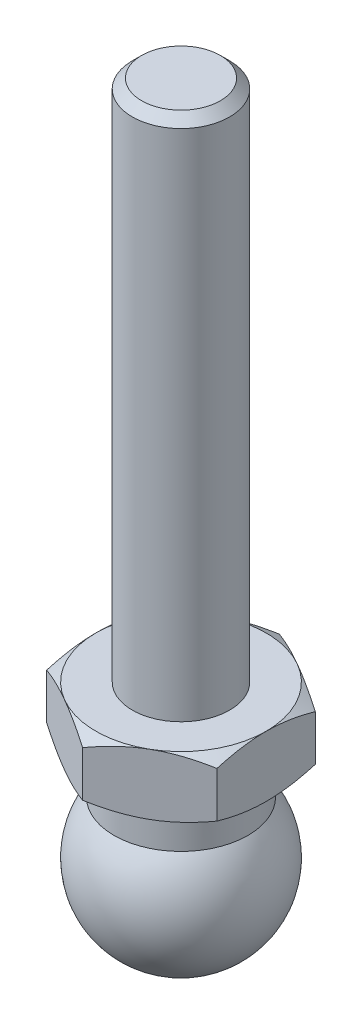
ISO-10303-21;
HEADER;
FILE_DESCRIPTION(('STEP AP214'),'2;1');
FILE_NAME('part.step','',(''),(''),'','','');
FILE_SCHEMA(('AUTOMOTIVE_DESIGN { 1 0 10303 214 1 1 1 1 }'));
ENDSEC;
DATA;
#1=APPLICATION_CONTEXT('core data for automotive mechanical design processes');
#2=APPLICATION_PROTOCOL_DEFINITION('international standard','automotive_design',2000,#1);
#3=PRODUCT_CONTEXT('',#1,'mechanical');
#4=PRODUCT('Part','Part','',(#3));
#5=PRODUCT_RELATED_PRODUCT_CATEGORY('part','',(#4));
#6=PRODUCT_DEFINITION_FORMATION('','',#4);
#7=PRODUCT_DEFINITION_CONTEXT('part definition',#1,'design');
#8=PRODUCT_DEFINITION('design','',#6,#7);
#9=PRODUCT_DEFINITION_SHAPE('','',#8);
#10=(LENGTH_UNIT() NAMED_UNIT(*) SI_UNIT(.MILLI.,.METRE.));
#11=(NAMED_UNIT(*) PLANE_ANGLE_UNIT() SI_UNIT($,.RADIAN.));
#12=(NAMED_UNIT(*) SI_UNIT($,.STERADIAN.) SOLID_ANGLE_UNIT());
#13=UNCERTAINTY_MEASURE_WITH_UNIT(LENGTH_MEASURE(1.E-05),#10,'distance_accuracy_value','');
#14=(GEOMETRIC_REPRESENTATION_CONTEXT(3) GLOBAL_UNCERTAINTY_ASSIGNED_CONTEXT((#13)) GLOBAL_UNIT_ASSIGNED_CONTEXT((#10,
#11,#12)) REPRESENTATION_CONTEXT('',''));
#15=CARTESIAN_POINT('',(0.,0.,0.));
#16=DIRECTION('',(0.,0.,1.));
#17=DIRECTION('',(1.,0.,0.));
#18=AXIS2_PLACEMENT_3D('',#15,#16,#17);
#19=CARTESIAN_POINT('',(0.,19.5,0.));
#20=DIRECTION('',(0.,-1.,0.));
#21=DIRECTION('',(0.,0.,-1.));
#22=AXIS2_PLACEMENT_3D('',#19,#20,#21);
#23=CONICAL_SURFACE('',#22,7.,1.0471975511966);
#24=CARTESIAN_POINT('',(-7.,15.2688336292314,12.5023453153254));
#25=CARTESIAN_POINT('',(-7.,15.4184696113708,12.2052647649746));
#26=CARTESIAN_POINT('',(-7.,15.5671267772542,11.9076861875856));
#27=CARTESIAN_POINT('',(-7.,15.8620076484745,11.3113035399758));
#28=CARTESIAN_POINT('',(-7.,16.0082312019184,11.0124993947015));
#29=CARTESIAN_POINT('',(-7.,16.2980281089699,10.4128982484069));
#30=CARTESIAN_POINT('',(-7.,16.441595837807,10.1120985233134));
#31=CARTESIAN_POINT('',(-7.,16.7251296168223,9.50881013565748));
#32=CARTESIAN_POINT('',(-7.,16.8650957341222,9.20632150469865));
#33=CARTESIAN_POINT('',(-7.,17.1470427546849,8.58510325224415));
#34=CARTESIAN_POINT('',(-7.,17.2888108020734,8.26627671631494));
#35=CARTESIAN_POINT('',(-7.,17.5662200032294,7.62594250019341));
#36=CARTESIAN_POINT('',(-7.,17.7018608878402,7.30443470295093));
#37=CARTESIAN_POINT('',(-7.,17.9652496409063,6.65840905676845));
#38=CARTESIAN_POINT('',(-7.,18.0930022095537,6.33389313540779));
#39=CARTESIAN_POINT('',(-7.,18.3384540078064,5.68109770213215));
#40=CARTESIAN_POINT('',(-7.,18.4561543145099,5.35281859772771));
#41=CARTESIAN_POINT('',(-7.,18.7028165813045,4.61998548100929));
#42=CARTESIAN_POINT('',(-7.,18.8286623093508,4.21436746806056));
#43=CARTESIAN_POINT('',(-7.,19.0543524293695,3.39574912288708));
#44=CARTESIAN_POINT('',(-7.,19.1541980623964,2.98274914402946));
#45=CARTESIAN_POINT('',(-7.,19.2776062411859,2.36178861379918));
#46=CARTESIAN_POINT('',(-7.,19.3141378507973,2.15638627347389));
#47=CARTESIAN_POINT('',(-7.,19.3780104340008,1.74416917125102));
#48=CARTESIAN_POINT('',(-7.,19.4053527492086,1.53735462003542));
#49=CARTESIAN_POINT('',(-7.,19.4500375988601,1.1227076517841));
#50=CARTESIAN_POINT('',(-7.,19.467383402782,0.914875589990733));
#51=CARTESIAN_POINT('',(-7.,19.4915250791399,0.498594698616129));
#52=CARTESIAN_POINT('',(-7.,19.4983210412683,0.290145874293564));
#53=CARTESIAN_POINT('',(-7.,19.5011397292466,-0.128421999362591));
#54=CARTESIAN_POINT('',(-7.,19.4970795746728,-0.338541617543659));
#55=CARTESIAN_POINT('',(-7.,19.4781521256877,-0.758289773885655));
#56=CARTESIAN_POINT('',(-7.,19.463284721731,-0.967918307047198));
#57=CARTESIAN_POINT('',(-7.,19.4232345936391,-1.38625975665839));
#58=CARTESIAN_POINT('',(-7.,19.3980479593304,-1.59497229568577));
#59=CARTESIAN_POINT('',(-7.,19.3381380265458,-2.01100790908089));
#60=CARTESIAN_POINT('',(-7.,19.3034145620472,-2.21833095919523));
#61=CARTESIAN_POINT('',(-7.,19.1849408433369,-2.84522045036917));
#62=CARTESIAN_POINT('',(-7.,19.0876569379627,-3.26225118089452));
#63=CARTESIAN_POINT('',(-7.,18.8658468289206,-4.08879182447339));
#64=CARTESIAN_POINT('',(-7.,18.7413180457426,-4.4983010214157));
#65=CARTESIAN_POINT('',(-7.,18.4953846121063,-5.2406101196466));
#66=CARTESIAN_POINT('',(-7.,18.3771372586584,-5.5744719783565));
#67=CARTESIAN_POINT('',(-7.,18.1300009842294,-6.23825206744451));
#68=CARTESIAN_POINT('',(-7.,18.0011107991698,-6.56816982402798));
#69=CARTESIAN_POINT('',(-7.,17.7350197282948,-7.22486424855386));
#70=CARTESIAN_POINT('',(-7.,17.5978135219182,-7.55163874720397));
#71=CARTESIAN_POINT('',(-7.,17.3169731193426,-8.20238370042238));
#72=CARTESIAN_POINT('',(-7.,17.1733392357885,-8.5263542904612));
#73=CARTESIAN_POINT('',(-7.,16.8876445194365,-9.15729037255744));
#74=CARTESIAN_POINT('',(-7.,16.7458097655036,-9.46435857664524));
#75=CARTESIAN_POINT('',(-7.,16.4583976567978,-10.0767426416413));
#76=CARTESIAN_POINT('',(-7.,16.3128202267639,-10.3820584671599));
#77=CARTESIAN_POINT('',(-7.,16.018926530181,-10.990585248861));
#78=CARTESIAN_POINT('',(-7.,15.8706165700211,-11.2937992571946));
#79=CARTESIAN_POINT('',(-7.,15.5714843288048,-11.8989613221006));
#80=CARTESIAN_POINT('',(-7.,15.4206622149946,-12.2009094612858));
#81=CARTESIAN_POINT('',(-7.,15.2688336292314,-12.5023453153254));
#82=B_SPLINE_CURVE_WITH_KNOTS('',3,(#24,#25,#26,#27,#28,#29,#30,#31,#32,#33,#34,#35,#36,#37,#38,
#39,#40,#41,#42,#43,#44,#45,#46,#47,#48,#49,#50,#51,#52,#53,#54,#55,#56,#57,#58,#59,#60,#61,#62,
#63,#64,#65,#66,#67,#68,#69,#70,#71,#72,#73,#74,#75,#76,#77,#78,#79,#80,#81),.UNSPECIFIED.,.F.,
.F.,(4,2,2,2,2,2,2,2,2,2,2,2,2,2,2,2,2,2,2,2,2,2,2,2,2,2,2,2,4),(0.,0.997917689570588,
1.99589743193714,2.99579247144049,3.99566886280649,5.04239250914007,6.08916209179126,
7.13530182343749,8.18132932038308,9.45480706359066,10.7282240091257,11.3539282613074,
11.9795411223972,12.6049492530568,13.2303520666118,13.8605430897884,14.490740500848,
15.1211769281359,15.7516243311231,17.0349275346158,18.3183522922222,19.380686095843,
20.4431462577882,21.506293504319,22.5693890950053,23.5840866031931,24.5988045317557,
25.6114179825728,26.6239642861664),.UNSPECIFIED.);
#83=CARTESIAN_POINT('',(-7.,18.8747852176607,4.04145188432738));
#84=VERTEX_POINT('',#83);
#85=CARTESIAN_POINT('',(-7.,19.5,0.));
#86=VERTEX_POINT('',#85);
#87=EDGE_CURVE('E209',#84,#86,#82,.T.);
#88=ORIENTED_EDGE('',*,*,#87,.F.);
#89=CARTESIAN_POINT('',(0.0002,18.8747185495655,8.0830192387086));
#90=CARTESIAN_POINT('',(-0.153667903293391,18.9260001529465,7.99418356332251));
#91=CARTESIAN_POINT('',(-0.30810950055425,18.9749544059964,7.90501666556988));
#92=CARTESIAN_POINT('',(-0.618246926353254,19.0675672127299,7.72595873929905));
#93=CARTESIAN_POINT('',(-0.773943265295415,19.1112234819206,7.63606741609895));
#94=CARTESIAN_POINT('',(-1.24352516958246,19.2333884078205,7.36495417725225));
#95=CARTESIAN_POINT('',(-1.5592643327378,19.302874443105,7.18266208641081));
#96=CARTESIAN_POINT('',(-2.03176224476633,19.3843550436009,6.9098652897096));
#97=CARTESIAN_POINT('',(-2.18710922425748,19.4075665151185,6.82017566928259));
#98=CARTESIAN_POINT('',(-2.49850511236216,19.4464887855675,6.64039116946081));
#99=CARTESIAN_POINT('',(-2.65455395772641,19.4622002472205,6.55029632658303));
#100=CARTESIAN_POINT('',(-2.96692267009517,19.4857220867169,6.36995016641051));
#101=CARTESIAN_POINT('',(-3.12324202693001,19.4935414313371,6.27969914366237));
#102=CARTESIAN_POINT('',(-3.43601650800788,19.5011197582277,6.09911871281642));
#103=CARTESIAN_POINT('',(-3.59247162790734,19.500878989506,6.00878930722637));
#104=CARTESIAN_POINT('',(-4.02110687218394,19.4891402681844,5.76131663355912));
#105=CARTESIAN_POINT('',(-4.2931466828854,19.4694342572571,5.60425437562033));
#106=CARTESIAN_POINT('',(-4.83541944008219,19.4069465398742,5.29117305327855));
#107=CARTESIAN_POINT('',(-5.10565047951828,19.364143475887,5.13515508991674));
#108=CARTESIAN_POINT('',(-5.64901454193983,19.2571483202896,4.82144370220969));
#109=CARTESIAN_POINT('',(-5.92207900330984,19.1925029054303,4.66378986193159));
#110=CARTESIAN_POINT('',(-6.46413578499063,19.045783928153,4.35083323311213));
#111=CARTESIAN_POINT('',(-6.73313504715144,18.9637448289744,4.19552643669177));
#112=CARTESIAN_POINT('',(-7.0002,18.8747185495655,4.04133641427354));
#113=B_SPLINE_CURVE_WITH_KNOTS('',3,(#89,#90,#91,#92,#93,#94,#95,#96,#97,#98,#99,#100,#101,#102,
#103,#104,#105,#106,#107,#108,#109,#110,#111,#112),.UNSPECIFIED.,.F.,.F.,(4,2,2,2,2,2,2,2,2,2,2,
4),(0.,0.554727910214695,1.10969417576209,2.2219327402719,2.76443041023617,3.30688013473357,
3.8487128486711,4.39052882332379,5.33376515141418,6.27787517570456,7.2429241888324,
8.20607866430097),.UNSPECIFIED.);
#114=CARTESIAN_POINT('',(-3.5,19.5,6.06217782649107));
#115=VERTEX_POINT('',#114);
#116=EDGE_CURVE('E335',#115,#84,#113,.T.);
#117=ORIENTED_EDGE('',*,*,#116,.F.);
#118=CARTESIAN_POINT('',(0.,19.5,0.));
#119=DIRECTION('',(0.,-1.,0.));
#120=DIRECTION('',(0.,0.,-1.));
#121=AXIS2_PLACEMENT_3D('',#118,#119,#120);
#122=CIRCLE('',#121,7.);
#123=EDGE_CURVE('E176',#115,#86,#122,.T.);
#124=ORIENTED_EDGE('',*,*,#123,.T.);
#125=EDGE_LOOP('',(#88,#117,#124));
#126=FACE_BOUND('',#125,.T.);
#127=ADVANCED_FACE('F17',(#126),#23,.T.);
#128=CARTESIAN_POINT('',(-7.,18.8747852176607,-4.04145188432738));
#129=VERTEX_POINT('',#128);
#130=EDGE_CURVE('E212',#86,#129,#82,.T.);
#131=ORIENTED_EDGE('',*,*,#130,.F.);
#132=CARTESIAN_POINT('',(-3.5,19.5,-6.06217782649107));
#133=VERTEX_POINT('',#132);
#134=EDGE_CURVE('E193',#86,#133,#122,.T.);
#135=ORIENTED_EDGE('',*,*,#134,.T.);
#136=CARTESIAN_POINT('',(-7.0002,18.8747185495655,-4.04133641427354));
#137=CARTESIAN_POINT('',(-6.84633209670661,18.9260001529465,-4.13017208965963));
#138=CARTESIAN_POINT('',(-6.69189049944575,18.9749544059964,-4.21933898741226));
#139=CARTESIAN_POINT('',(-6.38175307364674,19.0675672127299,-4.39839691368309));
#140=CARTESIAN_POINT('',(-6.22605673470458,19.1112234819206,-4.48828823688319));
#141=CARTESIAN_POINT('',(-5.75647483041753,19.2333884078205,-4.75940147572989));
#142=CARTESIAN_POINT('',(-5.4407356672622,19.302874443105,-4.94169356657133));
#143=CARTESIAN_POINT('',(-4.96823775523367,19.3843550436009,-5.21449036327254));
#144=CARTESIAN_POINT('',(-4.81289077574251,19.4075665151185,-5.30417998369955));
#145=CARTESIAN_POINT('',(-4.50149488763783,19.4464887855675,-5.48396448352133));
#146=CARTESIAN_POINT('',(-4.34544604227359,19.4622002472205,-5.57405932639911));
#147=CARTESIAN_POINT('',(-4.03307732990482,19.4857220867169,-5.75440548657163));
#148=CARTESIAN_POINT('',(-3.87675797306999,19.4935414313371,-5.84465650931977));
#149=CARTESIAN_POINT('',(-3.56398349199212,19.5011197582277,-6.02523694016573));
#150=CARTESIAN_POINT('',(-3.40752837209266,19.500878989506,-6.11556634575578));
#151=CARTESIAN_POINT('',(-2.97889312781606,19.4891402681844,-6.36303901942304));
#152=CARTESIAN_POINT('',(-2.7068533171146,19.4694342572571,-6.52010127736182));
#153=CARTESIAN_POINT('',(-2.1645805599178,19.4069465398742,-6.83318259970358));
#154=CARTESIAN_POINT('',(-1.89434952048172,19.364143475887,-6.9892005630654));
#155=CARTESIAN_POINT('',(-1.35098545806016,19.2571483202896,-7.30291195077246));
#156=CARTESIAN_POINT('',(-1.07792099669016,19.1925029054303,-7.46056579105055));
#157=CARTESIAN_POINT('',(-0.53586421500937,19.045783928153,-7.77352241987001));
#158=CARTESIAN_POINT('',(-0.26686495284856,18.9637448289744,-7.92882921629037));
#159=CARTESIAN_POINT('',(0.000200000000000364,18.8747185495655,-8.0830192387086));
#160=B_SPLINE_CURVE_WITH_KNOTS('',3,(#136,#137,#138,#139,#140,#141,#142,#143,#144,#145,#146,
#147,#148,#149,#150,#151,#152,#153,#154,#155,#156,#157,#158,#159),.UNSPECIFIED.,.F.,.F.,(4,2,2,
2,2,2,2,2,2,2,2,4),(0.,0.554727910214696,1.10969417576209,2.2219327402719,2.76443041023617,
3.30688013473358,3.8487128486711,4.39052882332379,5.33376515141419,6.27787517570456,
7.2429241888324,8.20607866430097),.UNSPECIFIED.);
#161=EDGE_CURVE('E253',#129,#133,#160,.T.);
#162=ORIENTED_EDGE('',*,*,#161,.F.);
#163=EDGE_LOOP('',(#131,#135,#162));
#164=FACE_BOUND('',#163,.T.);
#165=ADVANCED_FACE('F131',(#164),#23,.T.);
#166=CARTESIAN_POINT('',(0.,18.8747852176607,-8.08290376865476));
#167=VERTEX_POINT('',#166);
#168=EDGE_CURVE('E248',#133,#167,#160,.T.);
#169=ORIENTED_EDGE('',*,*,#168,.F.);
#170=CARTESIAN_POINT('',(3.5,19.5,-6.06217782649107));
#171=VERTEX_POINT('',#170);
#172=EDGE_CURVE('E187',#133,#171,#122,.T.);
#173=ORIENTED_EDGE('',*,*,#172,.T.);
#174=CARTESIAN_POINT('',(-0.0002,18.8747185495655,-8.0830192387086));
#175=CARTESIAN_POINT('',(0.153667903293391,18.9260001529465,-7.99418356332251));
#176=CARTESIAN_POINT('',(0.30810950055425,18.9749544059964,-7.90501666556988));
#177=CARTESIAN_POINT('',(0.618246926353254,19.0675672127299,-7.72595873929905));
#178=CARTESIAN_POINT('',(0.773943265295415,19.1112234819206,-7.63606741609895));
#179=CARTESIAN_POINT('',(1.24352516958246,19.2333884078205,-7.36495417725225));
#180=CARTESIAN_POINT('',(1.5592643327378,19.302874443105,-7.18266208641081));
#181=CARTESIAN_POINT('',(2.03176224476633,19.3843550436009,-6.9098652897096));
#182=CARTESIAN_POINT('',(2.18710922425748,19.4075665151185,-6.82017566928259));
#183=CARTESIAN_POINT('',(2.49850511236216,19.4464887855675,-6.64039116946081));
#184=CARTESIAN_POINT('',(2.65455395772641,19.4622002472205,-6.55029632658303));
#185=CARTESIAN_POINT('',(2.96692267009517,19.4857220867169,-6.36995016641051));
#186=CARTESIAN_POINT('',(3.12324202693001,19.4935414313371,-6.27969914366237));
#187=CARTESIAN_POINT('',(3.43601650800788,19.5011197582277,-6.09911871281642));
#188=CARTESIAN_POINT('',(3.59247162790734,19.500878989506,-6.00878930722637));
#189=CARTESIAN_POINT('',(4.02110687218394,19.4891402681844,-5.76131663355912));
#190=CARTESIAN_POINT('',(4.2931466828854,19.4694342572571,-5.60425437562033));
#191=CARTESIAN_POINT('',(4.83541944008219,19.4069465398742,-5.29117305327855));
#192=CARTESIAN_POINT('',(5.10565047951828,19.364143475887,-5.13515508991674));
#193=CARTESIAN_POINT('',(5.64901454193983,19.2571483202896,-4.82144370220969));
#194=CARTESIAN_POINT('',(5.92207900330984,19.1925029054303,-4.66378986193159));
#195=CARTESIAN_POINT('',(6.46413578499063,19.045783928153,-4.35083323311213));
#196=CARTESIAN_POINT('',(6.73313504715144,18.9637448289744,-4.19552643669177));
#197=CARTESIAN_POINT('',(7.0002,18.8747185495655,-4.04133641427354));
#198=B_SPLINE_CURVE_WITH_KNOTS('',3,(#174,#175,#176,#177,#178,#179,#180,#181,#182,#183,#184,
#185,#186,#187,#188,#189,#190,#191,#192,#193,#194,#195,#196,#197),.UNSPECIFIED.,.F.,.F.,(4,2,2,
2,2,2,2,2,2,2,2,4),(0.,0.554727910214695,1.10969417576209,2.2219327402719,2.76443041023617,
3.30688013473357,3.8487128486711,4.39052882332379,5.33376515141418,6.27787517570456,
7.2429241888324,8.20607866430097),.UNSPECIFIED.);
#199=EDGE_CURVE('E260',#167,#171,#198,.T.);
#200=ORIENTED_EDGE('',*,*,#199,.F.);
#201=EDGE_LOOP('',(#169,#173,#200));
#202=FACE_BOUND('',#201,.T.);
#203=ADVANCED_FACE('F139',(#202),#23,.T.);
#204=CARTESIAN_POINT('',(7.,18.8747852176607,-4.04145188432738));
#205=VERTEX_POINT('',#204);
#206=EDGE_CURVE('E263',#171,#205,#198,.T.);
#207=ORIENTED_EDGE('',*,*,#206,.F.);
#208=CARTESIAN_POINT('',(7.,19.5,0.));
#209=VERTEX_POINT('',#208);
#210=EDGE_CURVE('E183',#171,#209,#122,.T.);
#211=ORIENTED_EDGE('',*,*,#210,.T.);
#212=CARTESIAN_POINT('',(7.,15.2688336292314,-12.5023453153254));
#213=CARTESIAN_POINT('',(7.,15.4184696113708,-12.2052647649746));
#214=CARTESIAN_POINT('',(7.,15.5671267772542,-11.9076861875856));
#215=CARTESIAN_POINT('',(7.,15.8620076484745,-11.3113035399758));
#216=CARTESIAN_POINT('',(7.,16.0082312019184,-11.0124993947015));
#217=CARTESIAN_POINT('',(7.,16.2980281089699,-10.4128982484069));
#218=CARTESIAN_POINT('',(7.,16.441595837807,-10.1120985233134));
#219=CARTESIAN_POINT('',(7.,16.7251296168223,-9.50881013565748));
#220=CARTESIAN_POINT('',(7.,16.8650957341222,-9.20632150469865));
#221=CARTESIAN_POINT('',(7.,17.1470427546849,-8.58510325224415));
#222=CARTESIAN_POINT('',(7.,17.2888108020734,-8.26627671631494));
#223=CARTESIAN_POINT('',(7.,17.5662200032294,-7.62594250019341));
#224=CARTESIAN_POINT('',(7.,17.7018608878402,-7.30443470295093));
#225=CARTESIAN_POINT('',(7.,17.9652496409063,-6.65840905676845));
#226=CARTESIAN_POINT('',(7.,18.0930022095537,-6.33389313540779));
#227=CARTESIAN_POINT('',(7.,18.3384540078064,-5.68109770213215));
#228=CARTESIAN_POINT('',(7.,18.4561543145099,-5.35281859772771));
#229=CARTESIAN_POINT('',(7.,18.7028165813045,-4.61998548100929));
#230=CARTESIAN_POINT('',(7.,18.8286623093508,-4.21436746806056));
#231=CARTESIAN_POINT('',(7.,19.0543524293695,-3.39574912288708));
#232=CARTESIAN_POINT('',(7.,19.1541980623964,-2.98274914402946));
#233=CARTESIAN_POINT('',(7.,19.2776062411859,-2.36178861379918));
#234=CARTESIAN_POINT('',(7.,19.3141378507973,-2.15638627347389));
#235=CARTESIAN_POINT('',(7.,19.3780104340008,-1.74416917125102));
#236=CARTESIAN_POINT('',(7.,19.4053527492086,-1.53735462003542));
#237=CARTESIAN_POINT('',(7.,19.4500375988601,-1.1227076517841));
#238=CARTESIAN_POINT('',(7.,19.467383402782,-0.914875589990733));
#239=CARTESIAN_POINT('',(7.,19.4915250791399,-0.498594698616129));
#240=CARTESIAN_POINT('',(7.,19.4983210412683,-0.290145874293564));
#241=CARTESIAN_POINT('',(7.,19.5011397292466,0.128421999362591));
#242=CARTESIAN_POINT('',(7.,19.4970795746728,0.338541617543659));
#243=CARTESIAN_POINT('',(7.,19.4781521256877,0.758289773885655));
#244=CARTESIAN_POINT('',(7.,19.463284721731,0.967918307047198));
#245=CARTESIAN_POINT('',(7.,19.4232345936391,1.38625975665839));
#246=CARTESIAN_POINT('',(7.,19.3980479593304,1.59497229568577));
#247=CARTESIAN_POINT('',(7.,19.3381380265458,2.01100790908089));
#248=CARTESIAN_POINT('',(7.,19.3034145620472,2.21833095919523));
#249=CARTESIAN_POINT('',(7.,19.1849408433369,2.84522045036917));
#250=CARTESIAN_POINT('',(7.,19.0876569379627,3.26225118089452));
#251=CARTESIAN_POINT('',(7.,18.8658468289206,4.08879182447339));
#252=CARTESIAN_POINT('',(7.,18.7413180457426,4.4983010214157));
#253=CARTESIAN_POINT('',(7.,18.4953846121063,5.2406101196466));
#254=CARTESIAN_POINT('',(7.,18.3771372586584,5.5744719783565));
#255=CARTESIAN_POINT('',(7.,18.1300009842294,6.23825206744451));
#256=CARTESIAN_POINT('',(7.,18.0011107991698,6.56816982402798));
#257=CARTESIAN_POINT('',(7.,17.7350197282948,7.22486424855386));
#258=CARTESIAN_POINT('',(7.,17.5978135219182,7.55163874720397));
#259=CARTESIAN_POINT('',(7.,17.3169731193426,8.20238370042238));
#260=CARTESIAN_POINT('',(7.,17.1733392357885,8.5263542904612));
#261=CARTESIAN_POINT('',(7.,16.8876445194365,9.15729037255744));
#262=CARTESIAN_POINT('',(7.,16.7458097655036,9.46435857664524));
#263=CARTESIAN_POINT('',(7.,16.4583976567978,10.0767426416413));
#264=CARTESIAN_POINT('',(7.,16.3128202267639,10.3820584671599));
#265=CARTESIAN_POINT('',(7.,16.018926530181,10.990585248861));
#266=CARTESIAN_POINT('',(7.,15.8706165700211,11.2937992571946));
#267=CARTESIAN_POINT('',(7.,15.5714843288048,11.8989613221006));
#268=CARTESIAN_POINT('',(7.,15.4206622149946,12.2009094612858));
#269=CARTESIAN_POINT('',(7.,15.2688336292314,12.5023453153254));
#270=B_SPLINE_CURVE_WITH_KNOTS('',3,(#212,#213,#214,#215,#216,#217,#218,#219,#220,#221,#222,
#223,#224,#225,#226,#227,#228,#229,#230,#231,#232,#233,#234,#235,#236,#237,#238,#239,#240,#241,
#242,#243,#244,#245,#246,#247,#248,#249,#250,#251,#252,#253,#254,#255,#256,#257,#258,#259,#260,
#261,#262,#263,#264,#265,#266,#267,#268,#269),.UNSPECIFIED.,.F.,.F.,(4,2,2,2,2,2,2,2,2,2,2,2,2,
2,2,2,2,2,2,2,2,2,2,2,2,2,2,2,4),(0.,0.997917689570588,1.99589743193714,2.99579247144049,
3.99566886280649,5.04239250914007,6.08916209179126,7.13530182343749,8.18132932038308,
9.45480706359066,10.7282240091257,11.3539282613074,11.9795411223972,12.6049492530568,
13.2303520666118,13.8605430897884,14.490740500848,15.1211769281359,15.7516243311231,
17.0349275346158,18.3183522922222,19.380686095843,20.4431462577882,21.506293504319,
22.5693890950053,23.5840866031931,24.5988045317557,25.6114179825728,26.6239642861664),.UNSPECIFIED.);
#271=EDGE_CURVE('E278',#205,#209,#270,.T.);
#272=ORIENTED_EDGE('',*,*,#271,.F.);
#273=EDGE_LOOP('',(#207,#211,#272));
#274=FACE_BOUND('',#273,.T.);
#275=ADVANCED_FACE('F154',(#274),#23,.T.);
#276=CARTESIAN_POINT('',(7.,18.8747852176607,4.04145188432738));
#277=VERTEX_POINT('',#276);
#278=EDGE_CURVE('E180',#209,#277,#270,.T.);
#279=ORIENTED_EDGE('',*,*,#278,.F.);
#280=CARTESIAN_POINT('',(3.5,19.5,6.06217782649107));
#281=VERTEX_POINT('',#280);
#282=EDGE_CURVE('E173',#209,#281,#122,.T.);
#283=ORIENTED_EDGE('',*,*,#282,.T.);
#284=CARTESIAN_POINT('',(7.0002,18.8747185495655,4.04133641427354));
#285=CARTESIAN_POINT('',(6.84633209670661,18.9260001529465,4.13017208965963));
#286=CARTESIAN_POINT('',(6.69189049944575,18.9749544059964,4.21933898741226));
#287=CARTESIAN_POINT('',(6.38175307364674,19.0675672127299,4.39839691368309));
#288=CARTESIAN_POINT('',(6.22605673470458,19.1112234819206,4.48828823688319));
#289=CARTESIAN_POINT('',(5.75647483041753,19.2333884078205,4.75940147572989));
#290=CARTESIAN_POINT('',(5.4407356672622,19.302874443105,4.94169356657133));
#291=CARTESIAN_POINT('',(4.96823775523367,19.3843550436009,5.21449036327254));
#292=CARTESIAN_POINT('',(4.81289077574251,19.4075665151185,5.30417998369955));
#293=CARTESIAN_POINT('',(4.50149488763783,19.4464887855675,5.48396448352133));
#294=CARTESIAN_POINT('',(4.34544604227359,19.4622002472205,5.57405932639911));
#295=CARTESIAN_POINT('',(4.03307732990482,19.4857220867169,5.75440548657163));
#296=CARTESIAN_POINT('',(3.87675797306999,19.4935414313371,5.84465650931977));
#297=CARTESIAN_POINT('',(3.56398349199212,19.5011197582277,6.02523694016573));
#298=CARTESIAN_POINT('',(3.40752837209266,19.500878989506,6.11556634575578));
#299=CARTESIAN_POINT('',(2.97889312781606,19.4891402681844,6.36303901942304));
#300=CARTESIAN_POINT('',(2.7068533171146,19.4694342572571,6.52010127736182));
#301=CARTESIAN_POINT('',(2.1645805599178,19.4069465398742,6.83318259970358));
#302=CARTESIAN_POINT('',(1.89434952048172,19.364143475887,6.9892005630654));
#303=CARTESIAN_POINT('',(1.35098545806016,19.2571483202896,7.30291195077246));
#304=CARTESIAN_POINT('',(1.07792099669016,19.1925029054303,7.46056579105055));
#305=CARTESIAN_POINT('',(0.53586421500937,19.045783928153,7.77352241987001));
#306=CARTESIAN_POINT('',(0.26686495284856,18.9637448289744,7.92882921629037));
#307=CARTESIAN_POINT('',(-0.000200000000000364,18.8747185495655,8.0830192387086));
#308=B_SPLINE_CURVE_WITH_KNOTS('',3,(#284,#285,#286,#287,#288,#289,#290,#291,#292,#293,#294,
#295,#296,#297,#298,#299,#300,#301,#302,#303,#304,#305,#306,#307),.UNSPECIFIED.,.F.,.F.,(4,2,2,
2,2,2,2,2,2,2,2,4),(0.,0.554727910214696,1.10969417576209,2.2219327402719,2.76443041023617,
3.30688013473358,3.8487128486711,4.39052882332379,5.33376515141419,6.27787517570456,
7.2429241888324,8.20607866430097),.UNSPECIFIED.);
#309=EDGE_CURVE('E163',#277,#281,#308,.T.);
#310=ORIENTED_EDGE('',*,*,#309,.F.);
#311=EDGE_LOOP('',(#279,#283,#310));
#312=FACE_BOUND('',#311,.T.);
#313=ADVANCED_FACE('F145',(#312),#23,.T.);
#314=CARTESIAN_POINT('',(0.,18.8747852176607,8.08290376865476));
#315=VERTEX_POINT('',#314);
#316=EDGE_CURVE('E158',#281,#315,#308,.T.);
#317=ORIENTED_EDGE('',*,*,#316,.F.);
#318=EDGE_CURVE('E160',#281,#115,#122,.T.);
#319=ORIENTED_EDGE('',*,*,#318,.T.);
#320=EDGE_CURVE('E36',#315,#115,#113,.T.);
#321=ORIENTED_EDGE('',*,*,#320,.F.);
#322=EDGE_LOOP('',(#317,#319,#321));
#323=FACE_BOUND('',#322,.T.);
#324=ADVANCED_FACE('F134',(#323),#23,.T.);
#325=CARTESIAN_POINT('',(0.,62.5,0.));
#326=DIRECTION('',(0.,-1.,0.));
#327=DIRECTION('',(0.,0.,-1.));
#328=AXIS2_PLACEMENT_3D('',#325,#326,#327);
#329=PLANE('',#328);
#330=CARTESIAN_POINT('',(0.,62.5,0.));
#331=DIRECTION('',(0.,-1.,0.));
#332=DIRECTION('',(0.,0.,-1.));
#333=AXIS2_PLACEMENT_3D('',#330,#331,#332);
#334=CIRCLE('',#333,3.233);
#335=CARTESIAN_POINT('',(0.,62.5,-3.233));
#336=VERTEX_POINT('',#335);
#337=EDGE_CURVE('E11',#336,#336,#334,.T.);
#338=ORIENTED_EDGE('',*,*,#337,.F.);
#339=EDGE_LOOP('',(#338));
#340=FACE_BOUND('',#339,.T.);
#341=ADVANCED_FACE('F19',(#340),#329,.F.);
#342=CARTESIAN_POINT('',(0.,62.5,0.));
#343=DIRECTION('',(0.,-1.,0.));
#344=DIRECTION('',(0.,0.,-1.));
#345=AXIS2_PLACEMENT_3D('',#342,#343,#344);
#346=CONICAL_SURFACE('',#345,3.233,0.785398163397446);
#347=CARTESIAN_POINT('',(0.,61.733,0.));
#348=DIRECTION('',(0.,-1.,0.));
#349=DIRECTION('',(0.,0.,-1.));
#350=AXIS2_PLACEMENT_3D('',#347,#348,#349);
#351=CIRCLE('',#350,4.);
#352=CARTESIAN_POINT('',(0.,61.733,-4.));
#353=VERTEX_POINT('',#352);
#354=EDGE_CURVE('E28',#353,#353,#351,.T.);
#355=ORIENTED_EDGE('',*,*,#354,.F.);
#356=EDGE_LOOP('',(#355));
#357=FACE_BOUND('',#356,.T.);
#358=ORIENTED_EDGE('',*,*,#337,.T.);
#359=EDGE_LOOP('',(#358));
#360=FACE_BOUND('',#359,.T.);
#361=ADVANCED_FACE('F152',(#357,#360),#346,.T.);
#362=CARTESIAN_POINT('',(0.,0.,0.));
#363=DIRECTION('',(0.,-1.,0.));
#364=DIRECTION('',(0.,0.,-1.));
#365=AXIS2_PLACEMENT_3D('',#362,#363,#364);
#366=CYLINDRICAL_SURFACE('',#365,4.);
#367=CARTESIAN_POINT('',(0.,19.5,0.));
#368=DIRECTION('',(0.,-1.,0.));
#369=DIRECTION('',(0.,0.,-1.));
#370=AXIS2_PLACEMENT_3D('',#367,#368,#369);
#371=CIRCLE('',#370,4.);
#372=CARTESIAN_POINT('',(0.,19.5,-4.));
#373=VERTEX_POINT('',#372);
#374=EDGE_CURVE('E182',#373,#373,#371,.T.);
#375=ORIENTED_EDGE('',*,*,#374,.F.);
#376=EDGE_LOOP('',(#375));
#377=FACE_BOUND('',#376,.T.);
#378=ORIENTED_EDGE('',*,*,#354,.T.);
#379=EDGE_LOOP('',(#378));
#380=FACE_BOUND('',#379,.T.);
#381=ADVANCED_FACE('F366',(#377,#380),#366,.T.);
#382=CARTESIAN_POINT('',(4.,19.5,0.));
#383=DIRECTION('',(0.,-1.,0.));
#384=DIRECTION('',(0.,0.,-1.));
#385=AXIS2_PLACEMENT_3D('',#382,#383,#384);
#386=PLANE('',#385);
#387=ORIENTED_EDGE('',*,*,#282,.F.);
#388=ORIENTED_EDGE('',*,*,#210,.F.);
#389=ORIENTED_EDGE('',*,*,#172,.F.);
#390=ORIENTED_EDGE('',*,*,#134,.F.);
#391=ORIENTED_EDGE('',*,*,#123,.F.);
#392=ORIENTED_EDGE('',*,*,#318,.F.);
#393=EDGE_LOOP('',(#387,#388,#389,#390,#391,#392));
#394=FACE_BOUND('',#393,.T.);
#395=ORIENTED_EDGE('',*,*,#374,.T.);
#396=EDGE_LOOP('',(#395));
#397=FACE_BOUND('',#396,.T.);
#398=ADVANCED_FACE('F170',(#394,#397),#386,.F.);
#399=CARTESIAN_POINT('',(-7.,14.3,-4.04145188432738));
#400=DIRECTION('',(-1.,0.,0.));
#401=DIRECTION('',(0.,0.,1.));
#402=AXIS2_PLACEMENT_3D('',#399,#400,#401);
#403=PLANE('',#402);
#404=ORIENTED_EDGE('',*,*,#87,.T.);
#405=ORIENTED_EDGE('',*,*,#130,.T.);
#406=DIRECTION('',(0.,1.,0.));
#407=VECTOR('',#406,1.);
#408=CARTESIAN_POINT('',(-7.,14.3,-4.04145188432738));
#409=LINE('',#408,#407);
#410=CARTESIAN_POINT('',(-7.,15.1252147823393,-4.04145188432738));
#411=VERTEX_POINT('',#410);
#412=EDGE_CURVE('E341',#411,#129,#409,.T.);
#413=ORIENTED_EDGE('',*,*,#412,.F.);
#414=CARTESIAN_POINT('',(-7.,18.7311663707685,-12.5023453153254));
#415=CARTESIAN_POINT('',(-7.,18.5815303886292,-12.2052647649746));
#416=CARTESIAN_POINT('',(-7.,18.4328732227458,-11.9076861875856));
#417=CARTESIAN_POINT('',(-7.,18.1379923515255,-11.3113035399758));
#418=CARTESIAN_POINT('',(-7.,17.9917687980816,-11.0124993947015));
#419=CARTESIAN_POINT('',(-7.,17.7019718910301,-10.4128982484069));
#420=CARTESIAN_POINT('',(-7.,17.558404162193,-10.1120985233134));
#421=CARTESIAN_POINT('',(-7.,17.2748703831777,-9.50881013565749));
#422=CARTESIAN_POINT('',(-7.,17.1349042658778,-9.20632150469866));
#423=CARTESIAN_POINT('',(-7.,16.8529572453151,-8.58510325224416));
#424=CARTESIAN_POINT('',(-7.,16.7111891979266,-8.26627671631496));
#425=CARTESIAN_POINT('',(-7.,16.4337799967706,-7.62594250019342));
#426=CARTESIAN_POINT('',(-7.,16.2981391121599,-7.30443470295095));
#427=CARTESIAN_POINT('',(-7.,16.0347503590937,-6.65840905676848));
#428=CARTESIAN_POINT('',(-7.,15.9069977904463,-6.33389313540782));
#429=CARTESIAN_POINT('',(-7.,15.6615459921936,-5.68109770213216));
#430=CARTESIAN_POINT('',(-7.,15.5438456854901,-5.35281859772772));
#431=CARTESIAN_POINT('',(-7.,15.2971834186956,-4.6199854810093));
#432=CARTESIAN_POINT('',(-7.,15.1713376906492,-4.21436746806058));
#433=CARTESIAN_POINT('',(-7.,14.9456475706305,-3.39574912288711));
#434=CARTESIAN_POINT('',(-7.,14.8458019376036,-2.98274914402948));
#435=CARTESIAN_POINT('',(-7.,14.7223937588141,-2.3617886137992));
#436=CARTESIAN_POINT('',(-7.,14.6858621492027,-2.1563862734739));
#437=CARTESIAN_POINT('',(-7.,14.6219895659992,-1.74416917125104));
#438=CARTESIAN_POINT('',(-7.,14.5946472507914,-1.53735462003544));
#439=CARTESIAN_POINT('',(-7.,14.5499624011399,-1.12270765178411));
#440=CARTESIAN_POINT('',(-7.,14.532616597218,-0.914875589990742));
#441=CARTESIAN_POINT('',(-7.,14.5084749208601,-0.498594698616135));
#442=CARTESIAN_POINT('',(-7.,14.5016789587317,-0.290145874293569));
#443=CARTESIAN_POINT('',(-7.,14.4988602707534,0.128421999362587));
#444=CARTESIAN_POINT('',(-7.,14.5029204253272,0.338541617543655));
#445=CARTESIAN_POINT('',(-7.,14.5218478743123,0.758289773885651));
#446=CARTESIAN_POINT('',(-7.,14.5367152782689,0.967918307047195));
#447=CARTESIAN_POINT('',(-7.,14.5767654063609,1.38625975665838));
#448=CARTESIAN_POINT('',(-7.,14.6019520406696,1.59497229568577));
#449=CARTESIAN_POINT('',(-7.,14.6618619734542,2.01100790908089));
#450=CARTESIAN_POINT('',(-7.,14.6965854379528,2.21833095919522));
#451=CARTESIAN_POINT('',(-7.,14.8150591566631,2.84522045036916));
#452=CARTESIAN_POINT('',(-7.,14.9123430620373,3.26225118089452));
#453=CARTESIAN_POINT('',(-7.,15.1341531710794,4.08879182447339));
#454=CARTESIAN_POINT('',(-7.,15.2586819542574,4.4983010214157));
#455=CARTESIAN_POINT('',(-7.,15.5046153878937,5.2406101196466));
#456=CARTESIAN_POINT('',(-7.,15.6228627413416,5.5744719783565));
#457=CARTESIAN_POINT('',(-7.,15.8699990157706,6.23825206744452));
#458=CARTESIAN_POINT('',(-7.,15.9988892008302,6.56816982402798));
#459=CARTESIAN_POINT('',(-7.,16.2649802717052,7.22486424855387));
#460=CARTESIAN_POINT('',(-7.,16.4021864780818,7.55163874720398));
#461=CARTESIAN_POINT('',(-7.,16.6830268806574,8.20238370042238));
#462=CARTESIAN_POINT('',(-7.,16.8266607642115,8.5263542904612));
#463=CARTESIAN_POINT('',(-7.,17.1123554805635,9.15729037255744));
#464=CARTESIAN_POINT('',(-7.,17.2541902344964,9.46435857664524));
#465=CARTESIAN_POINT('',(-7.,17.5416023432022,10.0767426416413));
#466=CARTESIAN_POINT('',(-7.,17.6871797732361,10.38205846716));
#467=CARTESIAN_POINT('',(-7.,17.981073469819,10.990585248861));
#468=CARTESIAN_POINT('',(-7.,18.1293834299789,11.2937992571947));
#469=CARTESIAN_POINT('',(-7.,18.4285156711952,11.8989613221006));
#470=CARTESIAN_POINT('',(-7.,18.5793377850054,12.2009094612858));
#471=CARTESIAN_POINT('',(-7.,18.7311663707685,12.5023453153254));
#472=B_SPLINE_CURVE_WITH_KNOTS('',3,(#414,#415,#416,#417,#418,#419,#420,#421,#422,#423,#424,
#425,#426,#427,#428,#429,#430,#431,#432,#433,#434,#435,#436,#437,#438,#439,#440,#441,#442,#443,
#444,#445,#446,#447,#448,#449,#450,#451,#452,#453,#454,#455,#456,#457,#458,#459,#460,#461,#462,
#463,#464,#465,#466,#467,#468,#469,#470,#471),.UNSPECIFIED.,.F.,.F.,(4,2,2,2,2,2,2,2,2,2,2,2,2,
2,2,2,2,2,2,2,2,2,2,2,2,2,2,2,4),(0.,0.997917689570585,1.99589743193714,2.99579247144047,
3.99566886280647,5.04239250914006,6.08916209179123,7.13530182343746,8.18132932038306,
9.45480706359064,10.7282240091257,11.3539282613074,11.9795411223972,12.6049492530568,
13.2303520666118,13.8605430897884,14.490740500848,15.1211769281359,15.7516243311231,
17.0349275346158,18.3183522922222,19.380686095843,20.4431462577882,21.506293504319,
22.5693890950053,23.5840866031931,24.5988045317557,25.6114179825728,26.6239642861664),.UNSPECIFIED.);
#473=CARTESIAN_POINT('',(-7.,14.5,0.));
#474=VERTEX_POINT('',#473);
#475=EDGE_CURVE('E219',#411,#474,#472,.T.);
#476=ORIENTED_EDGE('',*,*,#475,.T.);
#477=CARTESIAN_POINT('',(-7.,15.1252147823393,4.04145188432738));
#478=VERTEX_POINT('',#477);
#479=EDGE_CURVE('E220',#474,#478,#472,.T.);
#480=ORIENTED_EDGE('',*,*,#479,.T.);
#481=DIRECTION('',(0.,1.,0.));
#482=VECTOR('',#481,1.);
#483=CARTESIAN_POINT('',(-7.,14.3,4.04145188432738));
#484=LINE('',#483,#482);
#485=EDGE_CURVE('E358',#478,#84,#484,.T.);
#486=ORIENTED_EDGE('',*,*,#485,.T.);
#487=EDGE_LOOP('',(#404,#405,#413,#476,#480,#486));
#488=FACE_BOUND('',#487,.T.);
#489=ADVANCED_FACE('F226',(#488),#403,.T.);
#490=CARTESIAN_POINT('',(0.,14.3,-8.08290376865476));
#491=DIRECTION('',(-0.5,0.,-0.866025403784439));
#492=DIRECTION('',(-0.866025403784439,0.,0.5));
#493=AXIS2_PLACEMENT_3D('',#490,#491,#492);
#494=PLANE('',#493);
#495=ORIENTED_EDGE('',*,*,#161,.T.);
#496=ORIENTED_EDGE('',*,*,#168,.T.);
#497=DIRECTION('',(0.,1.,0.));
#498=VECTOR('',#497,1.);
#499=CARTESIAN_POINT('',(0.,14.3,-8.08290376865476));
#500=LINE('',#499,#498);
#501=CARTESIAN_POINT('',(0.,15.1252147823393,-8.08290376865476));
#502=VERTEX_POINT('',#501);
#503=EDGE_CURVE('E342',#502,#167,#500,.T.);
#504=ORIENTED_EDGE('',*,*,#503,.F.);
#505=CARTESIAN_POINT('',(0.000200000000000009,15.1252814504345,-8.0830192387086));
#506=CARTESIAN_POINT('',(-0.153667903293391,15.0739998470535,-7.99418356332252));
#507=CARTESIAN_POINT('',(-0.30810950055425,15.0250455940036,-7.90501666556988));
#508=CARTESIAN_POINT('',(-0.618246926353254,14.9324327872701,-7.72595873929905));
#509=CARTESIAN_POINT('',(-0.773943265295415,14.8887765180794,-7.63606741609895));
#510=CARTESIAN_POINT('',(-1.24352516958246,14.7666115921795,-7.36495417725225));
#511=CARTESIAN_POINT('',(-1.5592643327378,14.697125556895,-7.18266208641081));
#512=CARTESIAN_POINT('',(-2.03176224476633,14.6156449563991,-6.9098652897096));
#513=CARTESIAN_POINT('',(-2.18710922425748,14.5924334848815,-6.82017566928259));
#514=CARTESIAN_POINT('',(-2.49850511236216,14.5535112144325,-6.64039116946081));
#515=CARTESIAN_POINT('',(-2.65455395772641,14.5377997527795,-6.55029632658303));
#516=CARTESIAN_POINT('',(-2.96692267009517,14.5142779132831,-6.36995016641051));
#517=CARTESIAN_POINT('',(-3.12324202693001,14.5064585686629,-6.27969914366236));
#518=CARTESIAN_POINT('',(-3.43601650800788,14.4988802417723,-6.09911871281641));
#519=CARTESIAN_POINT('',(-3.59247162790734,14.499121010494,-6.00878930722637));
#520=CARTESIAN_POINT('',(-4.02110687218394,14.5108597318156,-5.76131663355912));
#521=CARTESIAN_POINT('',(-4.2931466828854,14.5305657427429,-5.60425437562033));
#522=CARTESIAN_POINT('',(-4.8354194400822,14.5930534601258,-5.29117305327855));
#523=CARTESIAN_POINT('',(-5.10565047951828,14.635856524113,-5.13515508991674));
#524=CARTESIAN_POINT('',(-5.64901454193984,14.7428516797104,-4.82144370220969));
#525=CARTESIAN_POINT('',(-5.92207900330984,14.8074970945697,-4.66378986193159));
#526=CARTESIAN_POINT('',(-6.46413578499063,14.954216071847,-4.35083323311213));
#527=CARTESIAN_POINT('',(-6.73313504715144,15.0362551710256,-4.19552643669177));
#528=CARTESIAN_POINT('',(-7.0002,15.1252814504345,-4.04133641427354));
#529=B_SPLINE_CURVE_WITH_KNOTS('',3,(#505,#506,#507,#508,#509,#510,#511,#512,#513,#514,#515,
#516,#517,#518,#519,#520,#521,#522,#523,#524,#525,#526,#527,#528),.UNSPECIFIED.,.F.,.F.,(4,2,2,
2,2,2,2,2,2,2,2,4),(0.,0.554727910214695,1.10969417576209,2.2219327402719,2.76443041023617,
3.30688013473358,3.8487128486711,4.39052882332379,5.33376515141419,6.27787517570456,
7.2429241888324,8.20607866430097),.UNSPECIFIED.);
#530=CARTESIAN_POINT('',(-3.5,14.5,-6.06217782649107));
#531=VERTEX_POINT('',#530);
#532=EDGE_CURVE('E254',#502,#531,#529,.T.);
#533=ORIENTED_EDGE('',*,*,#532,.T.);
#534=EDGE_CURVE('E242',#531,#411,#529,.T.);
#535=ORIENTED_EDGE('',*,*,#534,.T.);
#536=ORIENTED_EDGE('',*,*,#412,.T.);
#537=EDGE_LOOP('',(#495,#496,#504,#533,#535,#536));
#538=FACE_BOUND('',#537,.T.);
#539=ADVANCED_FACE('F230',(#538),#494,.T.);
#540=CARTESIAN_POINT('',(7.,14.3,-4.04145188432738));
#541=DIRECTION('',(0.5,0.,-0.866025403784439));
#542=DIRECTION('',(-0.866025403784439,0.,-0.5));
#543=AXIS2_PLACEMENT_3D('',#540,#541,#542);
#544=PLANE('',#543);
#545=ORIENTED_EDGE('',*,*,#199,.T.);
#546=ORIENTED_EDGE('',*,*,#206,.T.);
#547=DIRECTION('',(0.,1.,0.));
#548=VECTOR('',#547,1.);
#549=CARTESIAN_POINT('',(7.,14.3,-4.04145188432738));
#550=LINE('',#549,#548);
#551=CARTESIAN_POINT('',(7.,15.1252147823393,-4.04145188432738));
#552=VERTEX_POINT('',#551);
#553=EDGE_CURVE('E345',#552,#205,#550,.T.);
#554=ORIENTED_EDGE('',*,*,#553,.F.);
#555=CARTESIAN_POINT('',(7.0002,15.1252814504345,-4.04133641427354));
#556=CARTESIAN_POINT('',(6.84633209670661,15.0739998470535,-4.13017208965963));
#557=CARTESIAN_POINT('',(6.69189049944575,15.0250455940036,-4.21933898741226));
#558=CARTESIAN_POINT('',(6.38175307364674,14.9324327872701,-4.39839691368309));
#559=CARTESIAN_POINT('',(6.22605673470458,14.8887765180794,-4.48828823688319));
#560=CARTESIAN_POINT('',(5.75647483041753,14.7666115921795,-4.75940147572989));
#561=CARTESIAN_POINT('',(5.4407356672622,14.697125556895,-4.94169356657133));
#562=CARTESIAN_POINT('',(4.96823775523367,14.6156449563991,-5.21449036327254));
#563=CARTESIAN_POINT('',(4.81289077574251,14.5924334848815,-5.30417998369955));
#564=CARTESIAN_POINT('',(4.50149488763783,14.5535112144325,-5.48396448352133));
#565=CARTESIAN_POINT('',(4.34544604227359,14.5377997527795,-5.57405932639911));
#566=CARTESIAN_POINT('',(4.03307732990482,14.5142779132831,-5.75440548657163));
#567=CARTESIAN_POINT('',(3.87675797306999,14.5064585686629,-5.84465650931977));
#568=CARTESIAN_POINT('',(3.56398349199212,14.4988802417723,-6.02523694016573));
#569=CARTESIAN_POINT('',(3.40752837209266,14.499121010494,-6.11556634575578));
#570=CARTESIAN_POINT('',(2.97889312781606,14.5108597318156,-6.36303901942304));
#571=CARTESIAN_POINT('',(2.7068533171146,14.5305657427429,-6.52010127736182));
#572=CARTESIAN_POINT('',(2.1645805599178,14.5930534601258,-6.83318259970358));
#573=CARTESIAN_POINT('',(1.89434952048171,14.635856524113,-6.9892005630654));
#574=CARTESIAN_POINT('',(1.35098545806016,14.7428516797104,-7.30291195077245));
#575=CARTESIAN_POINT('',(1.07792099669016,14.8074970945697,-7.46056579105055));
#576=CARTESIAN_POINT('',(0.53586421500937,14.954216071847,-7.77352241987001));
#577=CARTESIAN_POINT('',(0.266864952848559,15.0362551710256,-7.92882921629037));
#578=CARTESIAN_POINT('',(-0.000199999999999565,15.1252814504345,-8.0830192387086));
#579=B_SPLINE_CURVE_WITH_KNOTS('',3,(#555,#556,#557,#558,#559,#560,#561,#562,#563,#564,#565,
#566,#567,#568,#569,#570,#571,#572,#573,#574,#575,#576,#577,#578),.UNSPECIFIED.,.F.,.F.,(4,2,2,
2,2,2,2,2,2,2,2,4),(0.,0.554727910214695,1.10969417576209,2.2219327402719,2.76443041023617,
3.30688013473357,3.8487128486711,4.39052882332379,5.33376515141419,6.27787517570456,
7.2429241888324,8.20607866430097),.UNSPECIFIED.);
#580=CARTESIAN_POINT('',(3.5,14.5,-6.06217782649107));
#581=VERTEX_POINT('',#580);
#582=EDGE_CURVE('E266',#552,#581,#579,.T.);
#583=ORIENTED_EDGE('',*,*,#582,.T.);
#584=EDGE_CURVE('E272',#581,#502,#579,.T.);
#585=ORIENTED_EDGE('',*,*,#584,.T.);
#586=ORIENTED_EDGE('',*,*,#503,.T.);
#587=EDGE_LOOP('',(#545,#546,#554,#583,#585,#586));
#588=FACE_BOUND('',#587,.T.);
#589=ADVANCED_FACE('F236',(#588),#544,.T.);
#590=CARTESIAN_POINT('',(7.,14.3,4.04145188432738));
#591=DIRECTION('',(1.,0.,0.));
#592=DIRECTION('',(0.,0.,-1.));
#593=AXIS2_PLACEMENT_3D('',#590,#591,#592);
#594=PLANE('',#593);
#595=ORIENTED_EDGE('',*,*,#271,.T.);
#596=ORIENTED_EDGE('',*,*,#278,.T.);
#597=DIRECTION('',(0.,1.,0.));
#598=VECTOR('',#597,1.);
#599=CARTESIAN_POINT('',(7.,14.3,4.04145188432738));
#600=LINE('',#599,#598);
#601=CARTESIAN_POINT('',(7.,15.1252147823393,4.04145188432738));
#602=VERTEX_POINT('',#601);
#603=EDGE_CURVE('E354',#602,#277,#600,.T.);
#604=ORIENTED_EDGE('',*,*,#603,.F.);
#605=CARTESIAN_POINT('',(7.,18.7311663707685,12.5023453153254));
#606=CARTESIAN_POINT('',(7.,18.5815303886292,12.2052647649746));
#607=CARTESIAN_POINT('',(7.,18.4328732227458,11.9076861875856));
#608=CARTESIAN_POINT('',(7.,18.1379923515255,11.3113035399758));
#609=CARTESIAN_POINT('',(7.,17.9917687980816,11.0124993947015));
#610=CARTESIAN_POINT('',(7.,17.7019718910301,10.4128982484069));
#611=CARTESIAN_POINT('',(7.,17.558404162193,10.1120985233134));
#612=CARTESIAN_POINT('',(7.,17.2748703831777,9.50881013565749));
#613=CARTESIAN_POINT('',(7.,17.1349042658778,9.20632150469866));
#614=CARTESIAN_POINT('',(7.,16.8529572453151,8.58510325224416));
#615=CARTESIAN_POINT('',(7.,16.7111891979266,8.26627671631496));
#616=CARTESIAN_POINT('',(7.,16.4337799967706,7.62594250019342));
#617=CARTESIAN_POINT('',(7.,16.2981391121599,7.30443470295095));
#618=CARTESIAN_POINT('',(7.,16.0347503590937,6.65840905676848));
#619=CARTESIAN_POINT('',(7.,15.9069977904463,6.33389313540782));
#620=CARTESIAN_POINT('',(7.,15.6615459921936,5.68109770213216));
#621=CARTESIAN_POINT('',(7.,15.5438456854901,5.35281859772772));
#622=CARTESIAN_POINT('',(7.,15.2971834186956,4.6199854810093));
#623=CARTESIAN_POINT('',(7.,15.1713376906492,4.21436746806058));
#624=CARTESIAN_POINT('',(7.,14.9456475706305,3.39574912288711));
#625=CARTESIAN_POINT('',(7.,14.8458019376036,2.98274914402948));
#626=CARTESIAN_POINT('',(7.,14.7223937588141,2.3617886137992));
#627=CARTESIAN_POINT('',(7.,14.6858621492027,2.1563862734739));
#628=CARTESIAN_POINT('',(7.,14.6219895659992,1.74416917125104));
#629=CARTESIAN_POINT('',(7.,14.5946472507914,1.53735462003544));
#630=CARTESIAN_POINT('',(7.,14.5499624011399,1.12270765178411));
#631=CARTESIAN_POINT('',(7.,14.532616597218,0.914875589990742));
#632=CARTESIAN_POINT('',(7.,14.5084749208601,0.498594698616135));
#633=CARTESIAN_POINT('',(7.,14.5016789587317,0.290145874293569));
#634=CARTESIAN_POINT('',(7.,14.4988602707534,-0.128421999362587));
#635=CARTESIAN_POINT('',(7.,14.5029204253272,-0.338541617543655));
#636=CARTESIAN_POINT('',(7.,14.5218478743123,-0.758289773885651));
#637=CARTESIAN_POINT('',(7.,14.5367152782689,-0.967918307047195));
#638=CARTESIAN_POINT('',(7.,14.5767654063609,-1.38625975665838));
#639=CARTESIAN_POINT('',(7.,14.6019520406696,-1.59497229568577));
#640=CARTESIAN_POINT('',(7.,14.6618619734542,-2.01100790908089));
#641=CARTESIAN_POINT('',(7.,14.6965854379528,-2.21833095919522));
#642=CARTESIAN_POINT('',(7.,14.8150591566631,-2.84522045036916));
#643=CARTESIAN_POINT('',(7.,14.9123430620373,-3.26225118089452));
#644=CARTESIAN_POINT('',(7.,15.1341531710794,-4.08879182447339));
#645=CARTESIAN_POINT('',(7.,15.2586819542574,-4.4983010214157));
#646=CARTESIAN_POINT('',(7.,15.5046153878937,-5.2406101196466));
#647=CARTESIAN_POINT('',(7.,15.6228627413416,-5.5744719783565));
#648=CARTESIAN_POINT('',(7.,15.8699990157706,-6.23825206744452));
#649=CARTESIAN_POINT('',(7.,15.9988892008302,-6.56816982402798));
#650=CARTESIAN_POINT('',(7.,16.2649802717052,-7.22486424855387));
#651=CARTESIAN_POINT('',(7.,16.4021864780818,-7.55163874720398));
#652=CARTESIAN_POINT('',(7.,16.6830268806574,-8.20238370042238));
#653=CARTESIAN_POINT('',(7.,16.8266607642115,-8.5263542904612));
#654=CARTESIAN_POINT('',(7.,17.1123554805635,-9.15729037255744));
#655=CARTESIAN_POINT('',(7.,17.2541902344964,-9.46435857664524));
#656=CARTESIAN_POINT('',(7.,17.5416023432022,-10.0767426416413));
#657=CARTESIAN_POINT('',(7.,17.6871797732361,-10.38205846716));
#658=CARTESIAN_POINT('',(7.,17.981073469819,-10.990585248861));
#659=CARTESIAN_POINT('',(7.,18.1293834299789,-11.2937992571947));
#660=CARTESIAN_POINT('',(7.,18.4285156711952,-11.8989613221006));
#661=CARTESIAN_POINT('',(7.,18.5793377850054,-12.2009094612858));
#662=CARTESIAN_POINT('',(7.,18.7311663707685,-12.5023453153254));
#663=B_SPLINE_CURVE_WITH_KNOTS('',3,(#605,#606,#607,#608,#609,#610,#611,#612,#613,#614,#615,
#616,#617,#618,#619,#620,#621,#622,#623,#624,#625,#626,#627,#628,#629,#630,#631,#632,#633,#634,
#635,#636,#637,#638,#639,#640,#641,#642,#643,#644,#645,#646,#647,#648,#649,#650,#651,#652,#653,
#654,#655,#656,#657,#658,#659,#660,#661,#662),.UNSPECIFIED.,.F.,.F.,(4,2,2,2,2,2,2,2,2,2,2,2,2,
2,2,2,2,2,2,2,2,2,2,2,2,2,2,2,4),(0.,0.997917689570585,1.99589743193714,2.99579247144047,
3.99566886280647,5.04239250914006,6.08916209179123,7.13530182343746,8.18132932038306,
9.45480706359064,10.7282240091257,11.3539282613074,11.9795411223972,12.6049492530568,
13.2303520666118,13.8605430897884,14.490740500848,15.1211769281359,15.7516243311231,
17.0349275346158,18.3183522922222,19.380686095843,20.4431462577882,21.506293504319,
22.5693890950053,23.5840866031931,24.5988045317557,25.6114179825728,26.6239642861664),.UNSPECIFIED.);
#664=CARTESIAN_POINT('',(7.,14.5,0.));
#665=VERTEX_POINT('',#664);
#666=EDGE_CURVE('E316',#602,#665,#663,.T.);
#667=ORIENTED_EDGE('',*,*,#666,.T.);
#668=EDGE_CURVE('E311',#665,#552,#663,.T.);
#669=ORIENTED_EDGE('',*,*,#668,.T.);
#670=ORIENTED_EDGE('',*,*,#553,.T.);
#671=EDGE_LOOP('',(#595,#596,#604,#667,#669,#670));
#672=FACE_BOUND('',#671,.T.);
#673=ADVANCED_FACE('F321',(#672),#594,.T.);
#674=CARTESIAN_POINT('',(0.,14.3,8.08290376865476));
#675=DIRECTION('',(0.5,0.,0.866025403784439));
#676=DIRECTION('',(0.866025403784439,0.,-0.5));
#677=AXIS2_PLACEMENT_3D('',#674,#675,#676);
#678=PLANE('',#677);
#679=ORIENTED_EDGE('',*,*,#309,.T.);
#680=ORIENTED_EDGE('',*,*,#316,.T.);
#681=DIRECTION('',(0.,1.,0.));
#682=VECTOR('',#681,1.);
#683=CARTESIAN_POINT('',(0.,14.3,8.08290376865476));
#684=LINE('',#683,#682);
#685=CARTESIAN_POINT('',(0.,15.1252147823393,8.08290376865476));
#686=VERTEX_POINT('',#685);
#687=EDGE_CURVE('E357',#686,#315,#684,.T.);
#688=ORIENTED_EDGE('',*,*,#687,.F.);
#689=CARTESIAN_POINT('',(-0.000200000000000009,15.1252814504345,8.0830192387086));
#690=CARTESIAN_POINT('',(0.153667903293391,15.0739998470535,7.99418356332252));
#691=CARTESIAN_POINT('',(0.30810950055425,15.0250455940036,7.90501666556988));
#692=CARTESIAN_POINT('',(0.618246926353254,14.9324327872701,7.72595873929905));
#693=CARTESIAN_POINT('',(0.773943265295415,14.8887765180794,7.63606741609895));
#694=CARTESIAN_POINT('',(1.24352516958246,14.7666115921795,7.36495417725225));
#695=CARTESIAN_POINT('',(1.5592643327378,14.697125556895,7.18266208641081));
#696=CARTESIAN_POINT('',(2.03176224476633,14.6156449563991,6.9098652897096));
#697=CARTESIAN_POINT('',(2.18710922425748,14.5924334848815,6.82017566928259));
#698=CARTESIAN_POINT('',(2.49850511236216,14.5535112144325,6.64039116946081));
#699=CARTESIAN_POINT('',(2.65455395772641,14.5377997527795,6.55029632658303));
#700=CARTESIAN_POINT('',(2.96692267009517,14.5142779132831,6.36995016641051));
#701=CARTESIAN_POINT('',(3.12324202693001,14.5064585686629,6.27969914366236));
#702=CARTESIAN_POINT('',(3.43601650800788,14.4988802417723,6.09911871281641));
#703=CARTESIAN_POINT('',(3.59247162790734,14.499121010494,6.00878930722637));
#704=CARTESIAN_POINT('',(4.02110687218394,14.5108597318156,5.76131663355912));
#705=CARTESIAN_POINT('',(4.2931466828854,14.5305657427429,5.60425437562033));
#706=CARTESIAN_POINT('',(4.8354194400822,14.5930534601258,5.29117305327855));
#707=CARTESIAN_POINT('',(5.10565047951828,14.635856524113,5.13515508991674));
#708=CARTESIAN_POINT('',(5.64901454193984,14.7428516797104,4.82144370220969));
#709=CARTESIAN_POINT('',(5.92207900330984,14.8074970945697,4.66378986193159));
#710=CARTESIAN_POINT('',(6.46413578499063,14.954216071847,4.35083323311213));
#711=CARTESIAN_POINT('',(6.73313504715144,15.0362551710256,4.19552643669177));
#712=CARTESIAN_POINT('',(7.0002,15.1252814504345,4.04133641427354));
#713=B_SPLINE_CURVE_WITH_KNOTS('',3,(#689,#690,#691,#692,#693,#694,#695,#696,#697,#698,#699,
#700,#701,#702,#703,#704,#705,#706,#707,#708,#709,#710,#711,#712),.UNSPECIFIED.,.F.,.F.,(4,2,2,
2,2,2,2,2,2,2,2,4),(0.,0.554727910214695,1.10969417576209,2.2219327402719,2.76443041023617,
3.30688013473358,3.8487128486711,4.39052882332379,5.33376515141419,6.27787517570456,
7.2429241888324,8.20607866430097),.UNSPECIFIED.);
#714=CARTESIAN_POINT('',(3.5,14.5,6.06217782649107));
#715=VERTEX_POINT('',#714);
#716=EDGE_CURVE('E164',#686,#715,#713,.T.);
#717=ORIENTED_EDGE('',*,*,#716,.T.);
#718=EDGE_CURVE('E304',#715,#602,#713,.T.);
#719=ORIENTED_EDGE('',*,*,#718,.T.);
#720=ORIENTED_EDGE('',*,*,#603,.T.);
#721=EDGE_LOOP('',(#679,#680,#688,#717,#719,#720));
#722=FACE_BOUND('',#721,.T.);
#723=ADVANCED_FACE('F324',(#722),#678,.T.);
#724=CARTESIAN_POINT('',(-7.,14.3,4.04145188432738));
#725=DIRECTION('',(-0.5,0.,0.866025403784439));
#726=DIRECTION('',(0.866025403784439,0.,0.5));
#727=AXIS2_PLACEMENT_3D('',#724,#725,#726);
#728=PLANE('',#727);
#729=ORIENTED_EDGE('',*,*,#320,.T.);
#730=ORIENTED_EDGE('',*,*,#116,.T.);
#731=ORIENTED_EDGE('',*,*,#485,.F.);
#732=CARTESIAN_POINT('',(-7.0002,15.1252814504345,4.04133641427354));
#733=CARTESIAN_POINT('',(-6.84633209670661,15.0739998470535,4.13017208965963));
#734=CARTESIAN_POINT('',(-6.69189049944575,15.0250455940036,4.21933898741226));
#735=CARTESIAN_POINT('',(-6.38175307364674,14.9324327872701,4.39839691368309));
#736=CARTESIAN_POINT('',(-6.22605673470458,14.8887765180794,4.48828823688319));
#737=CARTESIAN_POINT('',(-5.75647483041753,14.7666115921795,4.75940147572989));
#738=CARTESIAN_POINT('',(-5.4407356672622,14.697125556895,4.94169356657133));
#739=CARTESIAN_POINT('',(-4.96823775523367,14.6156449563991,5.21449036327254));
#740=CARTESIAN_POINT('',(-4.81289077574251,14.5924334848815,5.30417998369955));
#741=CARTESIAN_POINT('',(-4.50149488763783,14.5535112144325,5.48396448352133));
#742=CARTESIAN_POINT('',(-4.34544604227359,14.5377997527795,5.57405932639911));
#743=CARTESIAN_POINT('',(-4.03307732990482,14.5142779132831,5.75440548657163));
#744=CARTESIAN_POINT('',(-3.87675797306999,14.5064585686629,5.84465650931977));
#745=CARTESIAN_POINT('',(-3.56398349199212,14.4988802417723,6.02523694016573));
#746=CARTESIAN_POINT('',(-3.40752837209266,14.499121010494,6.11556634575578));
#747=CARTESIAN_POINT('',(-2.97889312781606,14.5108597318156,6.36303901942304));
#748=CARTESIAN_POINT('',(-2.7068533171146,14.5305657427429,6.52010127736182));
#749=CARTESIAN_POINT('',(-2.1645805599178,14.5930534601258,6.83318259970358));
#750=CARTESIAN_POINT('',(-1.89434952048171,14.635856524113,6.9892005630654));
#751=CARTESIAN_POINT('',(-1.35098545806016,14.7428516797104,7.30291195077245));
#752=CARTESIAN_POINT('',(-1.07792099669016,14.8074970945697,7.46056579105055));
#753=CARTESIAN_POINT('',(-0.53586421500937,14.954216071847,7.77352241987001));
#754=CARTESIAN_POINT('',(-0.266864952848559,15.0362551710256,7.92882921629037));
#755=CARTESIAN_POINT('',(0.000199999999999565,15.1252814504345,8.0830192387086));
#756=B_SPLINE_CURVE_WITH_KNOTS('',3,(#732,#733,#734,#735,#736,#737,#738,#739,#740,#741,#742,
#743,#744,#745,#746,#747,#748,#749,#750,#751,#752,#753,#754,#755),.UNSPECIFIED.,.F.,.F.,(4,2,2,
2,2,2,2,2,2,2,2,4),(0.,0.554727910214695,1.10969417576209,2.2219327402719,2.76443041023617,
3.30688013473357,3.8487128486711,4.39052882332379,5.33376515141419,6.27787517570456,
7.2429241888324,8.20607866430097),.UNSPECIFIED.);
#757=CARTESIAN_POINT('',(-3.5,14.5,6.06217782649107));
#758=VERTEX_POINT('',#757);
#759=EDGE_CURVE('E43',#478,#758,#756,.T.);
#760=ORIENTED_EDGE('',*,*,#759,.T.);
#761=EDGE_CURVE('E293',#758,#686,#756,.T.);
#762=ORIENTED_EDGE('',*,*,#761,.T.);
#763=ORIENTED_EDGE('',*,*,#687,.T.);
#764=EDGE_LOOP('',(#729,#730,#731,#760,#762,#763));
#765=FACE_BOUND('',#764,.T.);
#766=ADVANCED_FACE('F329',(#765),#728,.T.);
#767=CARTESIAN_POINT('',(0.,0.,0.));
#768=DIRECTION('',(0.,-1.,0.));
#769=DIRECTION('',(0.,0.,-1.));
#770=AXIS2_PLACEMENT_3D('',#767,#768,#769);
#771=CYLINDRICAL_SURFACE('',#770,5.5);
#772=CARTESIAN_POINT('',(5.5,11.3301270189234,0.));
#773=CARTESIAN_POINT('',(5.50000190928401,11.3301270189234,0.0900075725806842));
#774=CARTESIAN_POINT('',(5.49779095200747,11.3301270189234,0.180014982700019));
#775=CARTESIAN_POINT('',(5.48895701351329,11.3301270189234,0.359813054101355));
#776=CARTESIAN_POINT('',(5.48233403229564,11.3301270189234,0.449603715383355));
#777=CARTESIAN_POINT('',(5.4646897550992,11.3301270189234,0.628751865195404));
#778=CARTESIAN_POINT('',(5.45366845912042,11.3301270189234,0.718109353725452));
#779=CARTESIAN_POINT('',(5.42725470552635,11.3301270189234,0.896175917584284));
#780=CARTESIAN_POINT('',(5.41186224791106,11.3301270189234,0.984884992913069));
#781=CARTESIAN_POINT('',(5.37674309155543,11.3301270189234,1.16144101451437));
#782=CARTESIAN_POINT('',(5.35701639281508,11.3301270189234,1.24928796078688));
#783=CARTESIAN_POINT('',(5.31327632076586,11.3301270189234,1.42390809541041));
#784=CARTESIAN_POINT('',(5.28926294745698,11.3301270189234,1.51068128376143));
#785=CARTESIAN_POINT('',(5.23700736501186,11.3301270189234,1.68294485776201));
#786=CARTESIAN_POINT('',(5.20876515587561,11.3301270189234,1.76843524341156));
#787=CARTESIAN_POINT('',(5.14811994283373,11.3301270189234,1.9379272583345));
#788=CARTESIAN_POINT('',(5.11571693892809,11.3301270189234,2.02192888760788));
#789=CARTESIAN_POINT('',(5.04682819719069,11.3301270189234,2.18824102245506));
#790=CARTESIAN_POINT('',(5.01034245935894,11.3301270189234,2.27055152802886));
#791=CARTESIAN_POINT('',(4.93337614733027,11.3301270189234,2.43328312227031));
#792=CARTESIAN_POINT('',(4.89289557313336,11.3301270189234,2.51370421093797));
#793=CARTESIAN_POINT('',(4.80803710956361,11.3301270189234,2.67246322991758));
#794=CARTESIAN_POINT('',(4.76365922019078,11.3301270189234,2.75080116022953));
#795=CARTESIAN_POINT('',(4.67111303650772,11.3301270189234,2.90520513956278));
#796=CARTESIAN_POINT('',(4.62294474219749,11.3301270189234,2.98127118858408));
#797=CARTESIAN_POINT('',(4.52293379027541,11.3301270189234,3.13094815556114));
#798=CARTESIAN_POINT('',(4.47109113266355,11.3301270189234,3.2045590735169));
#799=CARTESIAN_POINT('',(4.36385634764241,11.3301270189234,3.34914844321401));
#800=CARTESIAN_POINT('',(4.30846422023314,11.3301270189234,3.42012689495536));
#801=CARTESIAN_POINT('',(4.19426394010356,11.3301270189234,3.55928033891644));
#802=CARTESIAN_POINT('',(4.13545578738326,11.3301270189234,3.62745533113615));
#803=CARTESIAN_POINT('',(4.01456513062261,11.3301270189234,3.76083761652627));
#804=CARTESIAN_POINT('',(3.95248262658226,11.3301270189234,3.82604490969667));
#805=CARTESIAN_POINT('',(3.82519282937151,11.3301270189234,3.95333470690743));
#806=CARTESIAN_POINT('',(3.75998553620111,11.3301270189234,4.01541721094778));
#807=CARTESIAN_POINT('',(3.62660325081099,11.3301270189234,4.13630786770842));
#808=CARTESIAN_POINT('',(3.55842825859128,11.3301270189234,4.1951160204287));
#809=CARTESIAN_POINT('',(3.41927481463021,11.3301270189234,4.30931630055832));
#810=CARTESIAN_POINT('',(3.34829636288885,11.3301270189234,4.36470842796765));
#811=CARTESIAN_POINT('',(3.20370699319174,11.3301270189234,4.47194321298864));
#812=CARTESIAN_POINT('',(3.13009607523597,11.3301270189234,4.52378587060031));
#813=CARTESIAN_POINT('',(2.98041910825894,11.3301270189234,4.62379682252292));
#814=CARTESIAN_POINT('',(2.90435305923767,11.3301270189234,4.67196511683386));
#815=CARTESIAN_POINT('',(2.74994907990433,11.3301270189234,4.76451130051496));
#816=CARTESIAN_POINT('',(2.67161114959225,11.3301270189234,4.80888918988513));
#817=CARTESIAN_POINT('',(2.512852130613,11.3301270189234,4.89374765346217));
#818=CARTESIAN_POINT('',(2.43243104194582,11.3301270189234,4.93422822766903));
#819=CARTESIAN_POINT('',(2.26969944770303,11.3301270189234,5.01119453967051));
#820=CARTESIAN_POINT('',(2.18738894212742,11.3301270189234,5.04768027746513));
#821=CARTESIAN_POINT('',(2.02107680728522,11.3301270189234,5.11656901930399));
#822=CARTESIAN_POINT('',(1.93707517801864,11.3301270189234,5.14897202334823));
#823=CARTESIAN_POINT('',(1.7675831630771,11.3301270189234,5.20961723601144));
#824=CARTESIAN_POINT('',(1.68209277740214,11.3301270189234,5.23785944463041));
#825=CARTESIAN_POINT('',(1.50982920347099,11.3301270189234,5.29011502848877));
#826=CARTESIAN_POINT('',(1.42305601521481,11.3301270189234,5.31412840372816));
#827=CARTESIAN_POINT('',(1.24843588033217,11.3301270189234,5.35786847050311));
#828=CARTESIAN_POINT('',(1.16058893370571,11.3301270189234,5.37759516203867));
#829=CARTESIAN_POINT('',(0.98403291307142,11.3301270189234,5.41271433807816));
#830=CARTESIAN_POINT('',(0.89532383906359,11.3301270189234,5.42810682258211));
#831=CARTESIAN_POINT('',(0.71725727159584,11.3301270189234,5.454520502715));
#832=CARTESIAN_POINT('',(0.62789977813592,11.3301270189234,5.46554169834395));
#833=CARTESIAN_POINT('',(0.44875164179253,11.3301270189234,5.48318624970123));
#834=CARTESIAN_POINT('',(0.358960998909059,11.3301270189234,5.48980960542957));
#835=CARTESIAN_POINT('',(0.179162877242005,11.3301270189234,5.49864252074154));
#836=CARTESIAN_POINT('',(0.0891553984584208,11.3301270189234,5.50085208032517));
#837=CARTESIAN_POINT('',(-0.0908595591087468,11.3301270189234,5.50085208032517));
#838=CARTESIAN_POINT('',(-0.180867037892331,11.3301270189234,5.49864252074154));
#839=CARTESIAN_POINT('',(-0.360665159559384,11.3301270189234,5.48980960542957));
#840=CARTESIAN_POINT('',(-0.450455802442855,11.3301270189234,5.48318624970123));
#841=CARTESIAN_POINT('',(-0.629603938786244,11.3301270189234,5.46554169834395));
#842=CARTESIAN_POINT('',(-0.718961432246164,11.3301270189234,5.45452050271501));
#843=CARTESIAN_POINT('',(-0.897027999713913,11.3301270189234,5.42810682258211));
#844=CARTESIAN_POINT('',(-0.985737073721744,11.3301270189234,5.41271433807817));
#845=CARTESIAN_POINT('',(-1.16229309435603,11.3301270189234,5.37759516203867));
#846=CARTESIAN_POINT('',(-1.2501400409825,11.3301270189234,5.35786847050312));
#847=CARTESIAN_POINT('',(-1.42476017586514,11.3301270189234,5.31412840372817));
#848=CARTESIAN_POINT('',(-1.51153336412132,11.3301270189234,5.29011502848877));
#849=CARTESIAN_POINT('',(-1.68379693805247,11.3301270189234,5.23785944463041));
#850=CARTESIAN_POINT('',(-1.76928732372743,11.3301270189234,5.20961723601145));
#851=CARTESIAN_POINT('',(-1.93877933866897,11.3301270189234,5.14897202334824));
#852=CARTESIAN_POINT('',(-2.02278096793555,11.3301270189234,5.11656901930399));
#853=CARTESIAN_POINT('',(-2.18909310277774,11.3301270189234,5.04768027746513));
#854=CARTESIAN_POINT('',(-2.27140360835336,11.3301270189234,5.01119453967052));
#855=CARTESIAN_POINT('',(-2.43413520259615,11.3301270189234,4.93422822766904));
#856=CARTESIAN_POINT('',(-2.51455629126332,11.3301270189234,4.89374765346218));
#857=CARTESIAN_POINT('',(-2.67331531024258,11.3301270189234,4.80888918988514));
#858=CARTESIAN_POINT('',(-2.75165324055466,11.3301270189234,4.76451130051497));
#859=CARTESIAN_POINT('',(-2.906057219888,11.3301270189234,4.67196511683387));
#860=CARTESIAN_POINT('',(-2.98212326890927,11.3301270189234,4.62379682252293));
#861=CARTESIAN_POINT('',(-3.1318002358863,11.3301270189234,4.52378587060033));
#862=CARTESIAN_POINT('',(-3.20541115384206,11.3301270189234,4.47194321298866));
#863=CARTESIAN_POINT('',(-3.35000052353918,11.3301270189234,4.36470842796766));
#864=CARTESIAN_POINT('',(-3.42097897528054,11.3301270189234,4.30931630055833));
#865=CARTESIAN_POINT('',(-3.56013241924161,11.3301270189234,4.19511602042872));
#866=CARTESIAN_POINT('',(-3.62830741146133,11.3301270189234,4.13630786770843));
#867=CARTESIAN_POINT('',(-3.76168969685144,11.3301270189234,4.01541721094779));
#868=CARTESIAN_POINT('',(-3.82689699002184,11.3301270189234,3.95333470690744));
#869=CARTESIAN_POINT('',(-3.9541867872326,11.3301270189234,3.82604490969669));
#870=CARTESIAN_POINT('',(-4.01626929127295,11.3301270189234,3.76083761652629));
#871=CARTESIAN_POINT('',(-4.13715994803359,11.3301270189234,3.62745533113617));
#872=CARTESIAN_POINT('',(-4.19596810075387,11.3301270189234,3.55928033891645));
#873=CARTESIAN_POINT('',(-4.31016838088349,11.3301270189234,3.42012689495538));
#874=CARTESIAN_POINT('',(-4.36556050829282,11.3301270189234,3.34914844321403));
#875=CARTESIAN_POINT('',(-4.47279529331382,11.3301270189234,3.20455907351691));
#876=CARTESIAN_POINT('',(-4.52463795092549,11.3301270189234,3.13094815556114));
#877=CARTESIAN_POINT('',(-4.62464890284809,11.3301270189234,2.98127118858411));
#878=CARTESIAN_POINT('',(-4.67281719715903,11.3301270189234,2.90520513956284));
#879=CARTESIAN_POINT('',(-4.76536338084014,11.3301270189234,2.7508011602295));
#880=CARTESIAN_POINT('',(-4.80974127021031,11.3301270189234,2.67246322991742));
#881=CARTESIAN_POINT('',(-4.89459973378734,11.3301270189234,2.51370421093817));
#882=CARTESIAN_POINT('',(-4.9350803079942,11.3301270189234,2.433283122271));
#883=CARTESIAN_POINT('',(-5.01204661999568,11.3301270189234,2.27055152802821));
#884=CARTESIAN_POINT('',(-5.0485323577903,11.3301270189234,2.18824102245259));
#885=CARTESIAN_POINT('',(-5.11742109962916,11.3301270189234,2.0219288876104));
#886=CARTESIAN_POINT('',(-5.1498241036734,11.3301270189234,1.93792725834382));
#887=CARTESIAN_POINT('',(-5.21046931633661,11.3301270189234,1.76843524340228));
#888=CARTESIAN_POINT('',(-5.23871152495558,11.3301270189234,1.68294485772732));
#889=CARTESIAN_POINT('',(-5.29096710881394,11.3301270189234,1.51068128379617));
#890=CARTESIAN_POINT('',(-5.31498048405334,11.3301270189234,1.42390809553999));
#891=CARTESIAN_POINT('',(-5.35872055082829,11.3301270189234,1.24928796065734));
#892=CARTESIAN_POINT('',(-5.37844724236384,11.3301270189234,1.16144101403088));
#893=CARTESIAN_POINT('',(-5.41356641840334,11.3301270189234,0.984884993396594));
#894=CARTESIAN_POINT('',(-5.42895890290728,11.3301270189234,0.896175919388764));
#895=CARTESIAN_POINT('',(-5.45537258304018,11.3301270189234,0.718109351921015));
#896=CARTESIAN_POINT('',(-5.46639377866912,11.3301270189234,0.628751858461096));
#897=CARTESIAN_POINT('',(-5.4840383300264,11.3301270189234,0.449603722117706));
#898=CARTESIAN_POINT('',(-5.49066168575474,11.3301270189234,0.359813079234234));
#899=CARTESIAN_POINT('',(-5.49949460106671,11.3301270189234,0.180014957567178));
#900=CARTESIAN_POINT('',(-5.50170416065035,11.3301270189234,0.0900074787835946));
#901=CARTESIAN_POINT('',(-5.50170416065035,11.3301270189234,-0.090007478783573));
#902=CARTESIAN_POINT('',(-5.49949460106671,11.3301270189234,-0.180014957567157));
#903=CARTESIAN_POINT('',(-5.49066168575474,11.3301270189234,-0.359813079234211));
#904=CARTESIAN_POINT('',(-5.48403833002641,11.3301270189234,-0.449603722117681));
#905=CARTESIAN_POINT('',(-5.46639377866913,11.3301270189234,-0.62875185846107));
#906=CARTESIAN_POINT('',(-5.45537258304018,11.3301270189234,-0.718109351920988));
#907=CARTESIAN_POINT('',(-5.42895890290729,11.3301270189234,-0.896175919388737));
#908=CARTESIAN_POINT('',(-5.41356641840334,11.3301270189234,-0.984884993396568));
#909=CARTESIAN_POINT('',(-5.37844724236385,11.3301270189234,-1.16144101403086));
#910=CARTESIAN_POINT('',(-5.35872055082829,11.3301270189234,-1.24928796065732));
#911=CARTESIAN_POINT('',(-5.31498048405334,11.3301270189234,-1.42390809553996));
#912=CARTESIAN_POINT('',(-5.29096710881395,11.3301270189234,-1.51068128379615));
#913=CARTESIAN_POINT('',(-5.23871152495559,11.3301270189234,-1.68294485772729));
#914=CARTESIAN_POINT('',(-5.21046931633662,11.3301270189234,-1.76843524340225));
#915=CARTESIAN_POINT('',(-5.14982410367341,11.3301270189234,-1.93792725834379));
#916=CARTESIAN_POINT('',(-5.11742109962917,11.3301270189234,-2.02192888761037));
#917=CARTESIAN_POINT('',(-5.04853235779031,11.3301270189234,-2.18824102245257));
#918=CARTESIAN_POINT('',(-5.01204661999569,11.3301270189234,-2.27055152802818));
#919=CARTESIAN_POINT('',(-4.93508030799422,11.3301270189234,-2.43328312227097));
#920=CARTESIAN_POINT('',(-4.89459973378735,11.3301270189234,-2.51370421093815));
#921=CARTESIAN_POINT('',(-4.80974127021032,11.3301270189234,-2.6724632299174));
#922=CARTESIAN_POINT('',(-4.76536338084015,11.3301270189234,-2.75080116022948));
#923=CARTESIAN_POINT('',(-4.67281719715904,11.3301270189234,-2.90520513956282));
#924=CARTESIAN_POINT('',(-4.6246489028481,11.3301270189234,-2.98127118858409));
#925=CARTESIAN_POINT('',(-4.5246379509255,11.3301270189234,-3.13094815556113));
#926=CARTESIAN_POINT('',(-4.47279529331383,11.3301270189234,-3.20455907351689));
#927=CARTESIAN_POINT('',(-4.36556050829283,11.3301270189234,-3.34914844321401));
#928=CARTESIAN_POINT('',(-4.31016838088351,11.3301270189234,-3.42012689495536));
#929=CARTESIAN_POINT('',(-4.19596810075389,11.3301270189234,-3.55928033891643));
#930=CARTESIAN_POINT('',(-4.13715994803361,11.3301270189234,-3.62745533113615));
#931=CARTESIAN_POINT('',(-4.01626929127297,11.3301270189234,-3.76083761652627));
#932=CARTESIAN_POINT('',(-3.95418678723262,11.3301270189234,-3.82604490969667));
#933=CARTESIAN_POINT('',(-3.82689699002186,11.3301270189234,-3.95333470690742));
#934=CARTESIAN_POINT('',(-3.76168969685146,11.3301270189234,-4.01541721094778));
#935=CARTESIAN_POINT('',(-3.62830741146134,11.3301270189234,-4.13630786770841));
#936=CARTESIAN_POINT('',(-3.56013241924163,11.3301270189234,-4.1951160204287));
#937=CARTESIAN_POINT('',(-3.42097897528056,11.3301270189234,-4.30931630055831));
#938=CARTESIAN_POINT('',(-3.3500005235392,11.3301270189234,-4.36470842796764));
#939=CARTESIAN_POINT('',(-3.20541115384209,11.3301270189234,-4.47194321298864));
#940=CARTESIAN_POINT('',(-3.13180023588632,11.3301270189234,-4.52378587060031));
#941=CARTESIAN_POINT('',(-2.98212326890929,11.3301270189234,-4.62379682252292));
#942=CARTESIAN_POINT('',(-2.90605721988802,11.3301270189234,-4.67196511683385));
#943=CARTESIAN_POINT('',(-2.75165324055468,11.3301270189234,-4.76451130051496));
#944=CARTESIAN_POINT('',(-2.6733153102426,11.3301270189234,-4.80888918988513));
#945=CARTESIAN_POINT('',(-2.51455629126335,11.3301270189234,-4.89374765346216));
#946=CARTESIAN_POINT('',(-2.43413520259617,11.3301270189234,-4.93422822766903));
#947=CARTESIAN_POINT('',(-2.27140360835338,11.3301270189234,-5.01119453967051));
#948=CARTESIAN_POINT('',(-2.18909310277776,11.3301270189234,-5.04768027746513));
#949=CARTESIAN_POINT('',(-2.02278096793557,11.3301270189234,-5.11656901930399));
#950=CARTESIAN_POINT('',(-1.93877933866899,11.3301270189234,-5.14897202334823));
#951=CARTESIAN_POINT('',(-1.76928732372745,11.3301270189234,-5.20961723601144));
#952=CARTESIAN_POINT('',(-1.68379693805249,11.3301270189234,-5.2378594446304));
#953=CARTESIAN_POINT('',(-1.51153336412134,11.3301270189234,-5.29011502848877));
#954=CARTESIAN_POINT('',(-1.42476017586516,11.3301270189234,-5.31412840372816));
#955=CARTESIAN_POINT('',(-1.25014004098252,11.3301270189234,-5.35786847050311));
#956=CARTESIAN_POINT('',(-1.16229309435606,11.3301270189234,-5.37759516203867));
#957=CARTESIAN_POINT('',(-0.985737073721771,11.3301270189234,-5.41271433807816));
#958=CARTESIAN_POINT('',(-0.897027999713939,11.3301270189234,-5.42810682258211));
#959=CARTESIAN_POINT('',(-0.718961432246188,11.3301270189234,-5.454520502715));
#960=CARTESIAN_POINT('',(-0.62960393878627,11.3301270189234,-5.46554169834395));
#961=CARTESIAN_POINT('',(-0.450455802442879,11.3301270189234,-5.48318624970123));
#962=CARTESIAN_POINT('',(-0.360665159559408,11.3301270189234,-5.48980960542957));
#963=CARTESIAN_POINT('',(-0.180867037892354,11.3301270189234,-5.49864252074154));
#964=CARTESIAN_POINT('',(-0.0908595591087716,11.3301270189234,-5.50085208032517));
#965=CARTESIAN_POINT('',(0.089155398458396,11.3301270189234,-5.50085208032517));
#966=CARTESIAN_POINT('',(0.179162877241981,11.3301270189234,-5.49864252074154));
#967=CARTESIAN_POINT('',(0.358960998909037,11.3301270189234,-5.48980960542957));
#968=CARTESIAN_POINT('',(0.448751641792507,11.3301270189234,-5.48318624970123));
#969=CARTESIAN_POINT('',(0.627899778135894,11.3301270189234,-5.46554169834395));
#970=CARTESIAN_POINT('',(0.717257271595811,11.3301270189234,-5.45452050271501));
#971=CARTESIAN_POINT('',(0.89532383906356,11.3301270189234,-5.42810682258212));
#972=CARTESIAN_POINT('',(0.984032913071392,11.3301270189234,-5.41271433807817));
#973=CARTESIAN_POINT('',(1.16058893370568,11.3301270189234,-5.37759516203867));
#974=CARTESIAN_POINT('',(1.24843588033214,11.3301270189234,-5.35786847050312));
#975=CARTESIAN_POINT('',(1.42305601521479,11.3301270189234,-5.31412840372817));
#976=CARTESIAN_POINT('',(1.50982920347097,11.3301270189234,-5.29011502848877));
#977=CARTESIAN_POINT('',(1.68209277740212,11.3301270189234,-5.23785944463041));
#978=CARTESIAN_POINT('',(1.76758316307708,11.3301270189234,-5.20961723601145));
#979=CARTESIAN_POINT('',(1.93707517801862,11.3301270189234,-5.14897202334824));
#980=CARTESIAN_POINT('',(2.0210768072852,11.3301270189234,-5.116569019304));
#981=CARTESIAN_POINT('',(2.18738894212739,11.3301270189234,-5.04768027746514));
#982=CARTESIAN_POINT('',(2.26969944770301,11.3301270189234,-5.01119453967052));
#983=CARTESIAN_POINT('',(2.4324310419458,11.3301270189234,-4.93422822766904));
#984=CARTESIAN_POINT('',(2.51285213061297,11.3301270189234,-4.89374765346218));
#985=CARTESIAN_POINT('',(2.67161114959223,11.3301270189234,-4.80888918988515));
#986=CARTESIAN_POINT('',(2.7499490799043,11.3301270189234,-4.76451130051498));
#987=CARTESIAN_POINT('',(2.90435305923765,11.3301270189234,-4.67196511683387));
#988=CARTESIAN_POINT('',(2.98041910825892,11.3301270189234,-4.62379682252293));
#989=CARTESIAN_POINT('',(3.13009607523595,11.3301270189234,-4.52378587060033));
#990=CARTESIAN_POINT('',(3.20370699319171,11.3301270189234,-4.47194321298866));
#991=CARTESIAN_POINT('',(3.34829636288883,11.3301270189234,-4.36470842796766));
#992=CARTESIAN_POINT('',(3.41927481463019,11.3301270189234,-4.30931630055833));
#993=CARTESIAN_POINT('',(3.55842825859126,11.3301270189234,-4.19511602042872));
#994=CARTESIAN_POINT('',(3.62660325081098,11.3301270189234,-4.13630786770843));
#995=CARTESIAN_POINT('',(3.7599855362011,11.3301270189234,-4.0154172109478));
#996=CARTESIAN_POINT('',(3.8251928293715,11.3301270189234,-3.95333470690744));
#997=CARTESIAN_POINT('',(3.95248262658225,11.3301270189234,-3.82604490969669));
#998=CARTESIAN_POINT('',(4.0145651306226,11.3301270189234,-3.76083761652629));
#999=CARTESIAN_POINT('',(4.13545578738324,11.3301270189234,-3.62745533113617));
#1000=CARTESIAN_POINT('',(4.19426394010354,11.3301270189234,-3.55928033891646));
#1001=CARTESIAN_POINT('',(4.30846422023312,11.3301270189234,-3.42012689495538));
#1002=CARTESIAN_POINT('',(4.3638563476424,11.3301270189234,-3.34914844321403));
#1003=CARTESIAN_POINT('',(4.47109113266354,11.3301270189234,-3.20455907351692));
#1004=CARTESIAN_POINT('',(4.5229337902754,11.3301270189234,-3.13094815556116));
#1005=CARTESIAN_POINT('',(4.62294474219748,11.3301270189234,-2.98127118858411));
#1006=CARTESIAN_POINT('',(4.6711130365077,11.3301270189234,-2.9052051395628));
#1007=CARTESIAN_POINT('',(4.76365922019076,11.3301270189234,-2.75080116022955));
#1008=CARTESIAN_POINT('',(4.8080371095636,11.3301270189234,-2.67246322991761));
#1009=CARTESIAN_POINT('',(4.89289557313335,11.3301270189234,-2.513704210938));
#1010=CARTESIAN_POINT('',(4.93337614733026,11.3301270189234,-2.43328312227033));
#1011=CARTESIAN_POINT('',(5.01034245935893,11.3301270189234,-2.27055152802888));
#1012=CARTESIAN_POINT('',(5.04682819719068,11.3301270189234,-2.18824102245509));
#1013=CARTESIAN_POINT('',(5.11571693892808,11.3301270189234,-2.02192888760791));
#1014=CARTESIAN_POINT('',(5.14811994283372,11.3301270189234,-1.93792725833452));
#1015=CARTESIAN_POINT('',(5.2087651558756,11.3301270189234,-1.76843524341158));
#1016=CARTESIAN_POINT('',(5.23700736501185,11.3301270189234,-1.68294485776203));
#1017=CARTESIAN_POINT('',(5.28926294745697,11.3301270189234,-1.51068128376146));
#1018=CARTESIAN_POINT('',(5.31327632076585,11.3301270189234,-1.42390809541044));
#1019=CARTESIAN_POINT('',(5.35701639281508,11.3301270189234,-1.2492879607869));
#1020=CARTESIAN_POINT('',(5.37674309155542,11.3301270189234,-1.16144101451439));
#1021=CARTESIAN_POINT('',(5.41186224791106,11.3301270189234,-0.984884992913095));
#1022=CARTESIAN_POINT('',(5.42725470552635,11.3301270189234,-0.896175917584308));
#1023=CARTESIAN_POINT('',(5.45366845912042,11.3301270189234,-0.718109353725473));
#1024=CARTESIAN_POINT('',(5.4646897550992,11.3301270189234,-0.628751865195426));
#1025=CARTESIAN_POINT('',(5.48233403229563,11.3301270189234,-0.449603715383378));
#1026=CARTESIAN_POINT('',(5.48895701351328,11.3301270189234,-0.359813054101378));
#1027=CARTESIAN_POINT('',(5.49779095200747,11.3301270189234,-0.180014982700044));
#1028=CARTESIAN_POINT('',(5.50000190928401,11.3301270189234,-0.0900075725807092));
#1029=CARTESIAN_POINT('',(5.5,11.3301270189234,0.));
#1030=B_SPLINE_CURVE_WITH_KNOTS('',3,(#772,#773,#774,#775,#776,#777,#778,#779,#780,#781,#782,
#783,#784,#785,#786,#787,#788,#789,#790,#791,#792,#793,#794,#795,#796,#797,#798,#799,#800,#801,
#802,#803,#804,#805,#806,#807,#808,#809,#810,#811,#812,#813,#814,#815,#816,#817,#818,#819,#820,
#821,#822,#823,#824,#825,#826,#827,#828,#829,#830,#831,#832,#833,#834,#835,#836,#837,#838,#839,
#840,#841,#842,#843,#844,#845,#846,#847,#848,#849,#850,#851,#852,#853,#854,#855,#856,#857,#858,
#859,#860,#861,#862,#863,#864,#865,#866,#867,#868,#869,#870,#871,#872,#873,#874,#875,#876,#877,
#878,#879,#880,#881,#882,#883,#884,#885,#886,#887,#888,#889,#890,#891,#892,#893,#894,#895,#896,
#897,#898,#899,#900,#901,#902,#903,#904,#905,#906,#907,#908,#909,#910,#911,#912,#913,#914,#915,
#916,#917,#918,#919,#920,#921,#922,#923,#924,#925,#926,#927,#928,#929,#930,#931,#932,#933,#934,
#935,#936,#937,#938,#939,#940,#941,#942,#943,#944,#945,#946,#947,#948,#949,#950,#951,#952,#953,
#954,#955,#956,#957,#958,#959,#960,#961,#962,#963,#964,#965,#966,#967,#968,#969,#970,#971,#972,
#973,#974,#975,#976,#977,#978,#979,#980,#981,#982,#983,#984,#985,#986,#987,#988,#989,#990,#991,
#992,#993,#994,#995,#996,#997,#998,#999,#1000,#1001,#1002,#1003,#1004,#1005,#1006,#1007,#1008,
#1009,#1010,#1011,#1012,#1013,#1014,#1015,#1016,#1017,#1018,#1019,#1020,#1021,#1022,#1023,#1024,
#1025,#1026,#1027,#1028,#1029),.UNSPECIFIED.,.F.,.F.,(4,2,2,2,2,2,2,2,2,2,2,2,2,2,2,2,2,2,2,2,2,
2,2,2,2,2,2,2,2,2,2,2,2,2,2,2,2,2,2,2,2,2,2,2,2,2,2,2,2,2,2,2,2,2,2,2,2,2,2,2,2,2,2,2,2,2,2,2,2,
2,2,2,2,2,2,2,2,2,2,2,2,2,2,2,2,2,2,2,2,2,2,2,2,2,2,2,2,2,2,2,2,2,2,2,2,2,2,2,2,2,2,2,2,2,2,2,2,
2,2,2,2,2,2,2,2,2,2,2,4),(0.,0.269995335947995,0.539990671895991,0.809986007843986,
1.07998134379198,1.34997667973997,1.61997201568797,1.88996735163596,2.15996268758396,
2.42995802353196,2.69995335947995,2.96994869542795,3.23994403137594,3.50993936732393,
3.77993470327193,4.04993003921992,4.31992537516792,4.58992071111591,4.85991604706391,
5.1299113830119,5.3999067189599,5.66990205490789,5.93989739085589,6.20989272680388,
6.47988806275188,6.74988339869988,7.01987873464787,7.28987407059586,7.55986940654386,
7.82986474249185,8.09986007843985,8.36985541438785,8.63985075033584,8.90984608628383,
9.17984142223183,9.44983675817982,9.71983209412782,9.98982743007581,10.2598227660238,
10.5298181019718,10.7998134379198,11.0698087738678,11.3398041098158,11.6097994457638,
11.8797947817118,12.1497901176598,12.4197854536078,12.6897807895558,12.9597761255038,
13.2297714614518,13.4997667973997,13.7697621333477,14.0397574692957,14.3097528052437,
14.5797481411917,14.8497434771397,15.1197388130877,15.3897341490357,15.6597294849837,
15.9297248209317,16.1997201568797,16.4697154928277,16.7397108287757,17.0097061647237,
17.2797015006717,17.5496968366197,17.8196921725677,18.0896875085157,18.3596828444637,
18.6296781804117,18.8996735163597,19.1696688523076,19.4396641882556,19.7096595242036,
19.9796548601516,20.2496501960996,20.5196455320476,20.7896408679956,21.0596362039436,
21.3296315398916,21.5996268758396,21.8696222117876,22.1396175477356,22.4096128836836,
22.6796082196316,22.9496035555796,23.2195988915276,23.4895942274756,23.7595895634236,
24.0295848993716,24.2995802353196,24.5695755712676,24.8395709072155,25.1095662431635,
25.3795615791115,25.6495569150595,25.9195522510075,26.1895475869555,26.4595429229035,
26.7295382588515,26.9995335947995,27.2695289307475,27.5395242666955,27.8095196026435,
28.0795149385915,28.3495102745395,28.6195056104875,28.8895009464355,29.1594962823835,
29.4294916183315,29.6994869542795,29.9694822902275,30.2394776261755,30.5094729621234,
30.7794682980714,31.0494636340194,31.3194589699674,31.5894543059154,31.8594496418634,
32.1294449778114,32.3994403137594,32.6694356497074,32.9394309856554,33.2094263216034,
33.4794216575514,33.7494169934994,34.0194123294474,34.2894076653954,34.5594030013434),.UNSPECIFIED.);
#1031=CARTESIAN_POINT('',(5.5,11.3301270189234,0.));
#1032=VERTEX_POINT('',#1031);
#1033=EDGE_CURVE('E359',#1032,#1032,#1030,.T.);
#1034=ORIENTED_EDGE('',*,*,#1033,.F.);
#1035=EDGE_LOOP('',(#1034));
#1036=FACE_BOUND('',#1035,.T.);
#1037=CARTESIAN_POINT('',(0.,14.5,0.));
#1038=DIRECTION('',(0.,-1.,0.));
#1039=DIRECTION('',(0.,0.,-1.));
#1040=AXIS2_PLACEMENT_3D('',#1037,#1038,#1039);
#1041=CIRCLE('',#1040,5.5);
#1042=CARTESIAN_POINT('',(0.,14.5,-5.5));
#1043=VERTEX_POINT('',#1042);
#1044=EDGE_CURVE('E204',#1043,#1043,#1041,.T.);
#1045=ORIENTED_EDGE('',*,*,#1044,.T.);
#1046=EDGE_LOOP('',(#1045));
#1047=FACE_BOUND('',#1046,.T.);
#1048=ADVANCED_FACE('F288',(#1036,#1047),#771,.T.);
#1049=CARTESIAN_POINT('',(0.,17.,0.));
#1050=DIRECTION('',(0.,1.,0.));
#1051=DIRECTION('',(0.,0.,1.));
#1052=AXIS2_PLACEMENT_3D('',#1049,#1050,#1051);
#1053=CONICAL_SURFACE('',#1052,11.3301270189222,1.0471975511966);
#1054=ORIENTED_EDGE('',*,*,#582,.F.);
#1055=ORIENTED_EDGE('',*,*,#668,.F.);
#1056=CARTESIAN_POINT('',(0.,14.5,0.));
#1057=DIRECTION('',(0.,-1.,0.));
#1058=DIRECTION('',(0.,0.,-1.));
#1059=AXIS2_PLACEMENT_3D('',#1056,#1057,#1058);
#1060=CIRCLE('',#1059,7.);
#1061=EDGE_CURVE('E196',#581,#665,#1060,.T.);
#1062=ORIENTED_EDGE('',*,*,#1061,.F.);
#1063=EDGE_LOOP('',(#1054,#1055,#1062));
#1064=FACE_BOUND('',#1063,.T.);
#1065=ADVANCED_FACE('F125',(#1064),#1053,.T.);
#1066=ORIENTED_EDGE('',*,*,#584,.F.);
#1067=EDGE_CURVE('E203',#531,#581,#1060,.T.);
#1068=ORIENTED_EDGE('',*,*,#1067,.F.);
#1069=ORIENTED_EDGE('',*,*,#532,.F.);
#1070=EDGE_LOOP('',(#1066,#1068,#1069));
#1071=FACE_BOUND('',#1070,.T.);
#1072=ADVANCED_FACE('F287',(#1071),#1053,.T.);
#1073=ORIENTED_EDGE('',*,*,#534,.F.);
#1074=EDGE_CURVE('E207',#474,#531,#1060,.T.);
#1075=ORIENTED_EDGE('',*,*,#1074,.F.);
#1076=ORIENTED_EDGE('',*,*,#475,.F.);
#1077=EDGE_LOOP('',(#1073,#1075,#1076));
#1078=FACE_BOUND('',#1077,.T.);
#1079=ADVANCED_FACE('F437',(#1078),#1053,.T.);
#1080=ORIENTED_EDGE('',*,*,#479,.F.);
#1081=EDGE_CURVE('E201',#758,#474,#1060,.T.);
#1082=ORIENTED_EDGE('',*,*,#1081,.F.);
#1083=ORIENTED_EDGE('',*,*,#759,.F.);
#1084=EDGE_LOOP('',(#1080,#1082,#1083));
#1085=FACE_BOUND('',#1084,.T.);
#1086=ADVANCED_FACE('F126',(#1085),#1053,.T.);
#1087=ORIENTED_EDGE('',*,*,#666,.F.);
#1088=ORIENTED_EDGE('',*,*,#718,.F.);
#1089=EDGE_CURVE('E188',#665,#715,#1060,.T.);
#1090=ORIENTED_EDGE('',*,*,#1089,.F.);
#1091=EDGE_LOOP('',(#1087,#1088,#1090));
#1092=FACE_BOUND('',#1091,.T.);
#1093=ADVANCED_FACE('F446',(#1092),#1053,.T.);
#1094=CARTESIAN_POINT('',(7.,14.5,0.));
#1095=DIRECTION('',(0.,1.,0.));
#1096=DIRECTION('',(0.,0.,1.));
#1097=AXIS2_PLACEMENT_3D('',#1094,#1095,#1096);
#1098=PLANE('',#1097);
#1099=ORIENTED_EDGE('',*,*,#1044,.F.);
#1100=EDGE_LOOP('',(#1099));
#1101=FACE_BOUND('',#1100,.T.);
#1102=ORIENTED_EDGE('',*,*,#1061,.T.);
#1103=ORIENTED_EDGE('',*,*,#1089,.T.);
#1104=EDGE_CURVE('E195',#715,#758,#1060,.T.);
#1105=ORIENTED_EDGE('',*,*,#1104,.T.);
#1106=ORIENTED_EDGE('',*,*,#1081,.T.);
#1107=ORIENTED_EDGE('',*,*,#1074,.T.);
#1108=ORIENTED_EDGE('',*,*,#1067,.T.);
#1109=EDGE_LOOP('',(#1102,#1103,#1105,#1106,#1107,#1108));
#1110=FACE_BOUND('',#1109,.T.);
#1111=ADVANCED_FACE('F122',(#1101,#1110),#1098,.F.);
#1112=ORIENTED_EDGE('',*,*,#716,.F.);
#1113=ORIENTED_EDGE('',*,*,#761,.F.);
#1114=ORIENTED_EDGE('',*,*,#1104,.F.);
#1115=EDGE_LOOP('',(#1112,#1113,#1114));
#1116=FACE_BOUND('',#1115,.T.);
#1117=ADVANCED_FACE('F114',(#1116),#1053,.T.);
#1118=CARTESIAN_POINT('',(-0.000852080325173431,7.,-0.000852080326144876));
#1119=DIRECTION('',(-1.,0.,0.));
#1120=DIRECTION('',(0.,0.,-1.));
#1121=AXIS2_PLACEMENT_3D('',#1118,#1119,#1120);
#1122=CIRCLE('',#1121,7.);
#1123=TRIMMED_CURVE('',#1122,(PARAMETER_VALUE(-1.57091805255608)),
(PARAMETER_VALUE(1.57091805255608)),.T.,.PARAMETER.);
#1124=CARTESIAN_POINT('',(-0.000852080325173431,7.,0.));
#1125=DIRECTION('',(0.,-1.,0.));
#1126=AXIS1_PLACEMENT('',#1124,#1125);
#1127=SURFACE_OF_REVOLUTION('',#1123,#1126);
#1128=ORIENTED_EDGE('',*,*,#1033,.T.);
#1129=EDGE_LOOP('',(#1128));
#1130=FACE_BOUND('',#1129,.T.);
#1131=CARTESIAN_POINT('',(-0.000852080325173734,5.18600622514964E-08,0.));
#1132=VERTEX_POINT('',#1131);
#1133=VERTEX_LOOP('',#1132);
#1134=FACE_BOUND('',#1133,.T.);
#1135=ADVANCED_FACE('F112',(#1130,#1134),#1127,.T.);
#1136=CLOSED_SHELL('',(#127,#165,#203,#275,#313,#324,#341,#361,#381,#398,#489,#539,#589,#673,
#723,#766,#1048,#1065,#1072,#1079,#1086,#1093,#1111,#1117,#1135));
#1137=MANIFOLD_SOLID_BREP('B1',#1136);
#1138=ADVANCED_BREP_SHAPE_REPRESENTATION('',(#18,#1137),#14);
#1139=SHAPE_DEFINITION_REPRESENTATION(#9,#1138);
ENDSEC;
END-ISO-10303-21;
